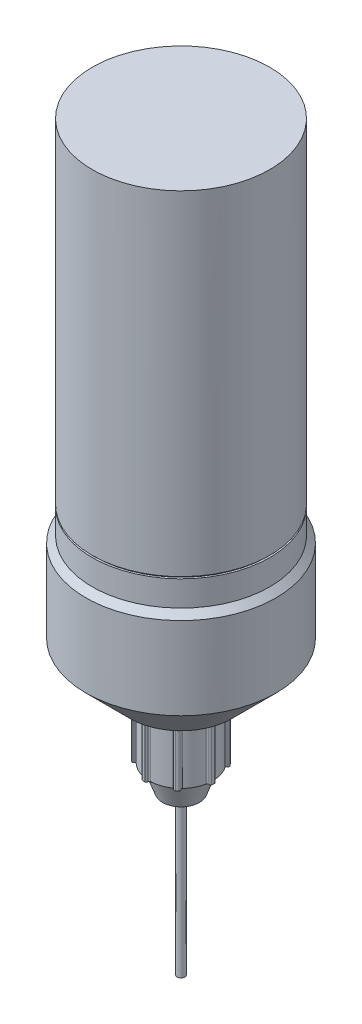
ISO-10303-21;
HEADER;
FILE_DESCRIPTION(('STEP AP214'),'2;1');
FILE_NAME('part.step','',(''),(''),'','','');
FILE_SCHEMA(('AUTOMOTIVE_DESIGN { 1 0 10303 214 1 1 1 1 }'));
ENDSEC;
DATA;
#1=APPLICATION_CONTEXT('core data for automotive mechanical design processes');
#2=APPLICATION_PROTOCOL_DEFINITION('international standard','automotive_design',2000,#1);
#3=PRODUCT_CONTEXT('',#1,'mechanical');
#4=PRODUCT('Part','Part','',(#3));
#5=PRODUCT_RELATED_PRODUCT_CATEGORY('part','',(#4));
#6=PRODUCT_DEFINITION_FORMATION('','',#4);
#7=PRODUCT_DEFINITION_CONTEXT('part definition',#1,'design');
#8=PRODUCT_DEFINITION('design','',#6,#7);
#9=PRODUCT_DEFINITION_SHAPE('','',#8);
#10=(LENGTH_UNIT() NAMED_UNIT(*) SI_UNIT(.MILLI.,.METRE.));
#11=(NAMED_UNIT(*) PLANE_ANGLE_UNIT() SI_UNIT($,.RADIAN.));
#12=(NAMED_UNIT(*) SI_UNIT($,.STERADIAN.) SOLID_ANGLE_UNIT());
#13=UNCERTAINTY_MEASURE_WITH_UNIT(LENGTH_MEASURE(1.E-05),#10,'distance_accuracy_value','');
#14=(GEOMETRIC_REPRESENTATION_CONTEXT(3) GLOBAL_UNCERTAINTY_ASSIGNED_CONTEXT((#13)) GLOBAL_UNIT_ASSIGNED_CONTEXT((#10,
#11,#12)) REPRESENTATION_CONTEXT('',''));
#15=CARTESIAN_POINT('',(0.,0.,0.));
#16=DIRECTION('',(0.,0.,1.));
#17=DIRECTION('',(1.,0.,0.));
#18=AXIS2_PLACEMENT_3D('',#15,#16,#17);
#19=CARTESIAN_POINT('',(0.,-14.2531803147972,0.));
#20=DIRECTION('',(0.,-1.,0.));
#21=DIRECTION('',(0.,0.,-1.));
#22=AXIS2_PLACEMENT_3D('',#19,#20,#21);
#23=PLANE('',#22);
#24=CARTESIAN_POINT('',(0.,-14.2531803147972,0.));
#25=DIRECTION('',(0.,-1.,0.));
#26=DIRECTION('',(0.,0.,-1.));
#27=AXIS2_PLACEMENT_3D('',#24,#25,#26);
#28=CIRCLE('',#27,0.4);
#29=CARTESIAN_POINT('',(0.,-14.2531803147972,-0.4));
#30=VERTEX_POINT('',#29);
#31=EDGE_CURVE('E20',#30,#30,#28,.T.);
#32=ORIENTED_EDGE('',*,*,#31,.T.);
#33=EDGE_LOOP('',(#32));
#34=FACE_BOUND('',#33,.T.);
#35=ADVANCED_FACE('F17',(#34),#23,.T.);
#36=CARTESIAN_POINT('',(0.,-14.2531803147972,0.));
#37=DIRECTION('',(0.,-1.,0.));
#38=DIRECTION('',(0.,0.,-1.));
#39=AXIS2_PLACEMENT_3D('',#36,#37,#38);
#40=CYLINDRICAL_SURFACE('',#39,0.4);
#41=CARTESIAN_POINT('',(0.,-52.2531803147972,0.));
#42=DIRECTION('',(0.,-1.,0.));
#43=DIRECTION('',(0.,0.,-1.));
#44=AXIS2_PLACEMENT_3D('',#41,#42,#43);
#45=CIRCLE('',#44,0.4);
#46=CARTESIAN_POINT('',(0.,-52.2531803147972,-0.4));
#47=VERTEX_POINT('',#46);
#48=EDGE_CURVE('E453',#47,#47,#45,.F.);
#49=ORIENTED_EDGE('',*,*,#48,.F.);
#50=EDGE_LOOP('',(#49));
#51=FACE_BOUND('',#50,.T.);
#52=ORIENTED_EDGE('',*,*,#31,.F.);
#53=EDGE_LOOP('',(#52));
#54=FACE_BOUND('',#53,.T.);
#55=ADVANCED_FACE('F461',(#51,#54),#40,.F.);
#56=CARTESIAN_POINT('',(0.,-52.2531803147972,0.));
#57=DIRECTION('',(0.,-1.,0.));
#58=DIRECTION('',(0.,0.,-1.));
#59=AXIS2_PLACEMENT_3D('',#56,#57,#58);
#60=PLANE('',#59);
#61=CARTESIAN_POINT('',(0.,-52.2531803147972,0.));
#62=DIRECTION('',(0.,1.,0.));
#63=DIRECTION('',(0.,0.,1.));
#64=AXIS2_PLACEMENT_3D('',#61,#62,#63);
#65=CIRCLE('',#64,0.6);
#66=CARTESIAN_POINT('',(0.,-52.2531803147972,0.6));
#67=VERTEX_POINT('',#66);
#68=EDGE_CURVE('E1086',#67,#67,#65,.T.);
#69=ORIENTED_EDGE('',*,*,#68,.F.);
#70=EDGE_LOOP('',(#69));
#71=FACE_BOUND('',#70,.T.);
#72=ORIENTED_EDGE('',*,*,#48,.T.);
#73=EDGE_LOOP('',(#72));
#74=FACE_BOUND('',#73,.T.);
#75=ADVANCED_FACE('F463',(#71,#74),#60,.T.);
#76=CARTESIAN_POINT('',(3.28559934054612,-23.2531803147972,4.15870616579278));
#77=DIRECTION('',(0.,1.,0.));
#78=DIRECTION('',(0.,0.,1.));
#79=AXIS2_PLACEMENT_3D('',#76,#77,#78);
#80=CYLINDRICAL_SURFACE('',#79,0.2);
#81=CARTESIAN_POINT('',(3.28559934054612,-13.2531803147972,4.15870616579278));
#82=DIRECTION('',(0.,1.,0.));
#83=DIRECTION('',(0.,0.,1.));
#84=AXIS2_PLACEMENT_3D('',#81,#82,#83);
#85=CIRCLE('',#84,0.2);
#86=CARTESIAN_POINT('',(3.40958422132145,-13.2531803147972,4.3156384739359));
#87=VERTEX_POINT('',#86);
#88=CARTESIAN_POINT('',(3.12410013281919,-13.2531803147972,4.27668076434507));
#89=VERTEX_POINT('',#88);
#90=EDGE_CURVE('E449',#87,#89,#85,.F.);
#91=ORIENTED_EDGE('',*,*,#90,.T.);
#92=DIRECTION('',(0.,1.,0.));
#93=VECTOR('',#92,1.);
#94=CARTESIAN_POINT('',(3.12410013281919,-13.2531803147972,4.27668076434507));
#95=LINE('',#94,#93);
#96=CARTESIAN_POINT('',(3.12410013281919,-23.2531803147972,4.27668076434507));
#97=VERTEX_POINT('',#96);
#98=EDGE_CURVE('E782',#89,#97,#95,.F.);
#99=ORIENTED_EDGE('',*,*,#98,.T.);
#100=CARTESIAN_POINT('',(3.28559934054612,-23.2531803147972,4.15870616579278));
#101=DIRECTION('',(0.,1.,0.));
#102=DIRECTION('',(0.,0.,1.));
#103=AXIS2_PLACEMENT_3D('',#100,#101,#102);
#104=CIRCLE('',#103,0.2);
#105=CARTESIAN_POINT('',(3.40958422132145,-23.2531803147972,4.3156384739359));
#106=VERTEX_POINT('',#105);
#107=EDGE_CURVE('E452',#97,#106,#104,.T.);
#108=ORIENTED_EDGE('',*,*,#107,.T.);
#109=DIRECTION('',(0.,1.,0.));
#110=VECTOR('',#109,1.);
#111=CARTESIAN_POINT('',(3.40958422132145,-23.2531803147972,4.3156384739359));
#112=LINE('',#111,#110);
#113=EDGE_CURVE('E785',#87,#106,#112,.F.);
#114=ORIENTED_EDGE('',*,*,#113,.F.);
#115=EDGE_LOOP('',(#91,#99,#108,#114));
#116=FACE_BOUND('',#115,.T.);
#117=ADVANCED_FACE('F470',(#116),#80,.T.);
#118=CARTESIAN_POINT('',(0.,-23.2531803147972,0.));
#119=DIRECTION('',(0.,1.,0.));
#120=DIRECTION('',(0.,0.,1.));
#121=AXIS2_PLACEMENT_3D('',#118,#119,#120);
#122=CYLINDRICAL_SURFACE('',#121,5.5);
#123=CARTESIAN_POINT('',(0.,-23.2531803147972,0.));
#124=DIRECTION('',(0.,1.,0.));
#125=DIRECTION('',(0.,0.,1.));
#126=AXIS2_PLACEMENT_3D('',#123,#124,#125);
#127=CIRCLE('',#126,5.5);
#128=CARTESIAN_POINT('',(-0.640677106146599,-23.2531803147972,5.46255735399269));
#129=VERTEX_POINT('',#128);
#130=CARTESIAN_POINT('',(-0.207547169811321,-23.2531803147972,5.49608262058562));
#131=VERTEX_POINT('',#130);
#132=EDGE_CURVE('E443',#129,#131,#127,.T.);
#133=ORIENTED_EDGE('',*,*,#132,.T.);
#134=DIRECTION('',(0.,1.,0.));
#135=VECTOR('',#134,1.);
#136=CARTESIAN_POINT('',(-0.207547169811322,-23.2531803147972,5.49608262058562));
#137=LINE('',#136,#135);
#138=CARTESIAN_POINT('',(-0.207547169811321,-13.2531803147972,5.49608262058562));
#139=VERTEX_POINT('',#138);
#140=EDGE_CURVE('E423',#131,#139,#137,.T.);
#141=ORIENTED_EDGE('',*,*,#140,.T.);
#142=CARTESIAN_POINT('',(0.,-13.2531803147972,0.));
#143=DIRECTION('',(0.,1.,0.));
#144=DIRECTION('',(0.,0.,1.));
#145=AXIS2_PLACEMENT_3D('',#142,#143,#144);
#146=CIRCLE('',#145,5.5);
#147=CARTESIAN_POINT('',(-0.640677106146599,-13.2531803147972,5.46255735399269));
#148=VERTEX_POINT('',#147);
#149=EDGE_CURVE('E446',#139,#148,#146,.F.);
#150=ORIENTED_EDGE('',*,*,#149,.T.);
#151=DIRECTION('',(0.,1.,0.));
#152=VECTOR('',#151,1.);
#153=CARTESIAN_POINT('',(-0.640677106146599,-23.2531803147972,5.46255735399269));
#154=LINE('',#153,#152);
#155=EDGE_CURVE('E799',#129,#148,#154,.T.);
#156=ORIENTED_EDGE('',*,*,#155,.F.);
#157=EDGE_LOOP('',(#133,#141,#150,#156));
#158=FACE_BOUND('',#157,.T.);
#159=ADVANCED_FACE('F771',(#158),#122,.T.);
#160=CARTESIAN_POINT('',(-3.88641801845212,-23.2531803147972,3.60357530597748));
#161=DIRECTION('',(0.,1.,0.));
#162=DIRECTION('',(0.,0.,1.));
#163=AXIS2_PLACEMENT_3D('',#160,#161,#162);
#164=CYLINDRICAL_SURFACE('',#163,0.2);
#165=DIRECTION('',(0.,1.,0.));
#166=VECTOR('',#165,1.);
#167=CARTESIAN_POINT('',(-3.74499666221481,-13.2531803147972,3.74499666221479));
#168=LINE('',#167,#166);
#169=CARTESIAN_POINT('',(-3.74499666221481,-23.2531803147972,3.74499666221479));
#170=VERTEX_POINT('',#169);
#171=CARTESIAN_POINT('',(-3.74499666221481,-13.2531803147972,3.74499666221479));
#172=VERTEX_POINT('',#171);
#173=EDGE_CURVE('E1120',#170,#172,#168,.T.);
#174=ORIENTED_EDGE('',*,*,#173,.T.);
#175=CARTESIAN_POINT('',(-3.88641801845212,-13.2531803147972,3.60357530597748));
#176=DIRECTION('',(0.,1.,0.));
#177=DIRECTION('',(0.,0.,1.));
#178=AXIS2_PLACEMENT_3D('',#175,#176,#177);
#179=CIRCLE('',#178,0.2);
#180=CARTESIAN_POINT('',(-4.03307530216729,-13.2531803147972,3.73955927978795));
#181=VERTEX_POINT('',#180);
#182=EDGE_CURVE('E409',#172,#181,#179,.F.);
#183=ORIENTED_EDGE('',*,*,#182,.T.);
#184=DIRECTION('',(0.,1.,0.));
#185=VECTOR('',#184,1.);
#186=CARTESIAN_POINT('',(-4.03307530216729,-23.2531803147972,3.73955927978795));
#187=LINE('',#186,#185);
#188=CARTESIAN_POINT('',(-4.03307530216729,-23.2531803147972,3.73955927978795));
#189=VERTEX_POINT('',#188);
#190=EDGE_CURVE('E426',#189,#181,#187,.T.);
#191=ORIENTED_EDGE('',*,*,#190,.F.);
#192=CARTESIAN_POINT('',(-3.88641801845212,-23.2531803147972,3.60357530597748));
#193=DIRECTION('',(0.,1.,0.));
#194=DIRECTION('',(0.,0.,1.));
#195=AXIS2_PLACEMENT_3D('',#192,#193,#194);
#196=CIRCLE('',#195,0.2);
#197=EDGE_CURVE('E414',#189,#170,#196,.T.);
#198=ORIENTED_EDGE('',*,*,#197,.T.);
#199=EDGE_LOOP('',(#174,#183,#191,#198));
#200=FACE_BOUND('',#199,.T.);
#201=ADVANCED_FACE('F427',(#200),#164,.T.);
#202=CARTESIAN_POINT('',(0.,-23.2531803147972,0.));
#203=DIRECTION('',(0.,1.,0.));
#204=DIRECTION('',(0.,0.,1.));
#205=AXIS2_PLACEMENT_3D('',#202,#203,#204);
#206=CYLINDRICAL_SURFACE('',#205,5.5);
#207=CARTESIAN_POINT('',(0.,-23.2531803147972,0.));
#208=DIRECTION('',(0.,1.,0.));
#209=DIRECTION('',(0.,0.,1.));
#210=AXIS2_PLACEMENT_3D('',#207,#208,#209);
#211=CIRCLE('',#210,5.5);
#212=CARTESIAN_POINT('',(-4.31563847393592,-23.2531803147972,3.40958422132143));
#213=VERTEX_POINT('',#212);
#214=EDGE_CURVE('E418',#213,#189,#211,.T.);
#215=ORIENTED_EDGE('',*,*,#214,.T.);
#216=ORIENTED_EDGE('',*,*,#190,.T.);
#217=CARTESIAN_POINT('',(0.,-13.2531803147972,0.));
#218=DIRECTION('',(0.,1.,0.));
#219=DIRECTION('',(0.,0.,1.));
#220=AXIS2_PLACEMENT_3D('',#217,#218,#219);
#221=CIRCLE('',#220,5.5);
#222=CARTESIAN_POINT('',(-4.31563847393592,-13.2531803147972,3.40958422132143));
#223=VERTEX_POINT('',#222);
#224=EDGE_CURVE('E436',#181,#223,#221,.F.);
#225=ORIENTED_EDGE('',*,*,#224,.T.);
#226=DIRECTION('',(0.,1.,0.));
#227=VECTOR('',#226,1.);
#228=CARTESIAN_POINT('',(-4.31563847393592,-23.2531803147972,3.40958422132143));
#229=LINE('',#228,#227);
#230=EDGE_CURVE('E434',#213,#223,#229,.T.);
#231=ORIENTED_EDGE('',*,*,#230,.F.);
#232=EDGE_LOOP('',(#215,#216,#225,#231));
#233=FACE_BOUND('',#232,.T.);
#234=ADVANCED_FACE('F432',(#233),#206,.T.);
#235=CARTESIAN_POINT('',(0.,-23.2531803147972,0.));
#236=DIRECTION('',(0.,1.,0.));
#237=DIRECTION('',(0.,0.,1.));
#238=AXIS2_PLACEMENT_3D('',#235,#236,#237);
#239=CYLINDRICAL_SURFACE('',#238,5.5);
#240=CARTESIAN_POINT('',(0.,-23.2531803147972,0.));
#241=DIRECTION('',(0.,1.,0.));
#242=DIRECTION('',(0.,0.,1.));
#243=AXIS2_PLACEMENT_3D('',#240,#241,#242);
#244=CIRCLE('',#243,5.5);
#245=CARTESIAN_POINT('',(-5.46255735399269,-23.2531803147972,-0.640677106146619));
#246=VERTEX_POINT('',#245);
#247=CARTESIAN_POINT('',(-5.49608262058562,-23.2531803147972,-0.20754716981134));
#248=VERTEX_POINT('',#247);
#249=EDGE_CURVE('E1106',#246,#248,#244,.T.);
#250=ORIENTED_EDGE('',*,*,#249,.T.);
#251=DIRECTION('',(0.,1.,0.));
#252=VECTOR('',#251,1.);
#253=CARTESIAN_POINT('',(-5.49608262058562,-23.2531803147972,-0.20754716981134));
#254=LINE('',#253,#252);
#255=CARTESIAN_POINT('',(-5.49608262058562,-13.2531803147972,-0.20754716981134));
#256=VERTEX_POINT('',#255);
#257=EDGE_CURVE('E1058',#256,#248,#254,.F.);
#258=ORIENTED_EDGE('',*,*,#257,.F.);
#259=CARTESIAN_POINT('',(0.,-13.2531803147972,0.));
#260=DIRECTION('',(0.,1.,0.));
#261=DIRECTION('',(0.,0.,1.));
#262=AXIS2_PLACEMENT_3D('',#259,#260,#261);
#263=CIRCLE('',#262,5.5);
#264=CARTESIAN_POINT('',(-5.46255735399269,-13.2531803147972,-0.640677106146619));
#265=VERTEX_POINT('',#264);
#266=EDGE_CURVE('E430',#256,#265,#263,.F.);
#267=ORIENTED_EDGE('',*,*,#266,.T.);
#268=DIRECTION('',(0.,1.,0.));
#269=VECTOR('',#268,1.);
#270=CARTESIAN_POINT('',(-5.46255735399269,-23.2531803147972,-0.640677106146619));
#271=LINE('',#270,#269);
#272=EDGE_CURVE('E1048',#246,#265,#271,.T.);
#273=ORIENTED_EDGE('',*,*,#272,.F.);
#274=EDGE_LOOP('',(#250,#258,#267,#273));
#275=FACE_BOUND('',#274,.T.);
#276=ADVANCED_FACE('F762',(#275),#239,.T.);
#277=CARTESIAN_POINT('',(0.,-23.2531803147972,0.));
#278=DIRECTION('',(0.,1.,0.));
#279=DIRECTION('',(0.,0.,1.));
#280=AXIS2_PLACEMENT_3D('',#277,#278,#279);
#281=CYLINDRICAL_SURFACE('',#280,5.5);
#282=CARTESIAN_POINT('',(0.,-23.2531803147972,0.));
#283=DIRECTION('',(0.,1.,0.));
#284=DIRECTION('',(0.,0.,1.));
#285=AXIS2_PLACEMENT_3D('',#282,#283,#284);
#286=CIRCLE('',#285,5.5);
#287=CARTESIAN_POINT('',(-3.40958422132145,-23.2531803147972,-4.3156384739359));
#288=VERTEX_POINT('',#287);
#289=CARTESIAN_POINT('',(-3.73955927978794,-23.2531803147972,-4.0330753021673));
#290=VERTEX_POINT('',#289);
#291=EDGE_CURVE('E1102',#288,#290,#286,.T.);
#292=ORIENTED_EDGE('',*,*,#291,.T.);
#293=DIRECTION('',(0.,1.,0.));
#294=VECTOR('',#293,1.);
#295=CARTESIAN_POINT('',(-3.73955927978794,-23.2531803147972,-4.0330753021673));
#296=LINE('',#295,#294);
#297=CARTESIAN_POINT('',(-3.73955927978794,-13.2531803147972,-4.0330753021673));
#298=VERTEX_POINT('',#297);
#299=EDGE_CURVE('E1044',#298,#290,#296,.F.);
#300=ORIENTED_EDGE('',*,*,#299,.F.);
#301=CARTESIAN_POINT('',(0.,-13.2531803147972,0.));
#302=DIRECTION('',(0.,1.,0.));
#303=DIRECTION('',(0.,0.,1.));
#304=AXIS2_PLACEMENT_3D('',#301,#302,#303);
#305=CIRCLE('',#304,5.5);
#306=CARTESIAN_POINT('',(-3.40958422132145,-13.2531803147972,-4.3156384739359));
#307=VERTEX_POINT('',#306);
#308=EDGE_CURVE('E1104',#298,#307,#305,.F.);
#309=ORIENTED_EDGE('',*,*,#308,.T.);
#310=DIRECTION('',(0.,1.,0.));
#311=VECTOR('',#310,1.);
#312=CARTESIAN_POINT('',(-3.40958422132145,-23.2531803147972,-4.3156384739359));
#313=LINE('',#312,#311);
#314=EDGE_CURVE('E1034',#288,#307,#313,.T.);
#315=ORIENTED_EDGE('',*,*,#314,.F.);
#316=EDGE_LOOP('',(#292,#300,#309,#315));
#317=FACE_BOUND('',#316,.T.);
#318=ADVANCED_FACE('F758',(#317),#281,.T.);
#319=CARTESIAN_POINT('',(0.,-23.2531803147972,0.));
#320=DIRECTION('',(0.,1.,0.));
#321=DIRECTION('',(0.,0.,1.));
#322=AXIS2_PLACEMENT_3D('',#319,#320,#321);
#323=CYLINDRICAL_SURFACE('',#322,5.5);
#324=CARTESIAN_POINT('',(0.,-23.2531803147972,0.));
#325=DIRECTION('',(0.,1.,0.));
#326=DIRECTION('',(0.,0.,1.));
#327=AXIS2_PLACEMENT_3D('',#324,#325,#326);
#328=CIRCLE('',#327,5.5);
#329=CARTESIAN_POINT('',(0.640677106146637,-23.2531803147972,-5.46255735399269));
#330=VERTEX_POINT('',#329);
#331=CARTESIAN_POINT('',(0.207547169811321,-23.2531803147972,-5.49608262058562));
#332=VERTEX_POINT('',#331);
#333=EDGE_CURVE('E1097',#330,#332,#328,.T.);
#334=ORIENTED_EDGE('',*,*,#333,.T.);
#335=DIRECTION('',(0.,1.,0.));
#336=VECTOR('',#335,1.);
#337=CARTESIAN_POINT('',(0.207547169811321,-23.2531803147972,-5.49608262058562));
#338=LINE('',#337,#336);
#339=CARTESIAN_POINT('',(0.207547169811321,-13.2531803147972,-5.49608262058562));
#340=VERTEX_POINT('',#339);
#341=EDGE_CURVE('E1030',#340,#332,#338,.F.);
#342=ORIENTED_EDGE('',*,*,#341,.F.);
#343=CARTESIAN_POINT('',(0.,-13.2531803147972,0.));
#344=DIRECTION('',(0.,1.,0.));
#345=DIRECTION('',(0.,0.,1.));
#346=AXIS2_PLACEMENT_3D('',#343,#344,#345);
#347=CIRCLE('',#346,5.5);
#348=CARTESIAN_POINT('',(0.640677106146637,-13.2531803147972,-5.46255735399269));
#349=VERTEX_POINT('',#348);
#350=EDGE_CURVE('E1099',#340,#349,#347,.F.);
#351=ORIENTED_EDGE('',*,*,#350,.T.);
#352=DIRECTION('',(0.,1.,0.));
#353=VECTOR('',#352,1.);
#354=CARTESIAN_POINT('',(0.640677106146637,-23.2531803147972,-5.46255735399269));
#355=LINE('',#354,#353);
#356=EDGE_CURVE('E1020',#330,#349,#355,.T.);
#357=ORIENTED_EDGE('',*,*,#356,.F.);
#358=EDGE_LOOP('',(#334,#342,#351,#357));
#359=FACE_BOUND('',#358,.T.);
#360=ADVANCED_FACE('F754',(#359),#323,.T.);
#361=CARTESIAN_POINT('',(0.,-23.2531803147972,0.));
#362=DIRECTION('',(0.,1.,0.));
#363=DIRECTION('',(0.,0.,1.));
#364=AXIS2_PLACEMENT_3D('',#361,#362,#363);
#365=CYLINDRICAL_SURFACE('',#364,5.5);
#366=CARTESIAN_POINT('',(0.,-23.2531803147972,0.));
#367=DIRECTION('',(0.,1.,0.));
#368=DIRECTION('',(0.,0.,1.));
#369=AXIS2_PLACEMENT_3D('',#366,#367,#368);
#370=CIRCLE('',#369,5.5);
#371=CARTESIAN_POINT('',(4.31563847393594,-23.2531803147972,-3.4095842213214));
#372=VERTEX_POINT('',#371);
#373=CARTESIAN_POINT('',(4.03307530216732,-23.2531803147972,-3.73955927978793));
#374=VERTEX_POINT('',#373);
#375=EDGE_CURVE('E1092',#372,#374,#370,.T.);
#376=ORIENTED_EDGE('',*,*,#375,.T.);
#377=DIRECTION('',(0.,1.,0.));
#378=VECTOR('',#377,1.);
#379=CARTESIAN_POINT('',(4.03307530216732,-23.2531803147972,-3.73955927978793));
#380=LINE('',#379,#378);
#381=CARTESIAN_POINT('',(4.03307530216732,-13.2531803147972,-3.73955927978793));
#382=VERTEX_POINT('',#381);
#383=EDGE_CURVE('E1016',#382,#374,#380,.F.);
#384=ORIENTED_EDGE('',*,*,#383,.F.);
#385=CARTESIAN_POINT('',(0.,-13.2531803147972,0.));
#386=DIRECTION('',(0.,1.,0.));
#387=DIRECTION('',(0.,0.,1.));
#388=AXIS2_PLACEMENT_3D('',#385,#386,#387);
#389=CIRCLE('',#388,5.5);
#390=CARTESIAN_POINT('',(4.31563847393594,-13.2531803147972,-3.4095842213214));
#391=VERTEX_POINT('',#390);
#392=EDGE_CURVE('E1094',#382,#391,#389,.F.);
#393=ORIENTED_EDGE('',*,*,#392,.T.);
#394=DIRECTION('',(0.,1.,0.));
#395=VECTOR('',#394,1.);
#396=CARTESIAN_POINT('',(4.31563847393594,-23.2531803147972,-3.4095842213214));
#397=LINE('',#396,#395);
#398=EDGE_CURVE('E1006',#372,#391,#397,.T.);
#399=ORIENTED_EDGE('',*,*,#398,.F.);
#400=EDGE_LOOP('',(#376,#384,#393,#399));
#401=FACE_BOUND('',#400,.T.);
#402=ADVANCED_FACE('F750',(#401),#365,.T.);
#403=CARTESIAN_POINT('',(0.,-23.2531803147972,0.));
#404=DIRECTION('',(0.,1.,0.));
#405=DIRECTION('',(0.,0.,1.));
#406=AXIS2_PLACEMENT_3D('',#403,#404,#405);
#407=CYLINDRICAL_SURFACE('',#406,5.5);
#408=CARTESIAN_POINT('',(0.,-23.2531803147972,0.));
#409=DIRECTION('',(0.,1.,0.));
#410=DIRECTION('',(0.,0.,1.));
#411=AXIS2_PLACEMENT_3D('',#408,#409,#410);
#412=CIRCLE('',#411,5.5);
#413=CARTESIAN_POINT('',(5.46255735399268,-23.2531803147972,0.640677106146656));
#414=VERTEX_POINT('',#413);
#415=CARTESIAN_POINT('',(5.49608262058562,-23.2531803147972,0.207547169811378));
#416=VERTEX_POINT('',#415);
#417=EDGE_CURVE('E805',#414,#416,#412,.T.);
#418=ORIENTED_EDGE('',*,*,#417,.T.);
#419=DIRECTION('',(0.,1.,0.));
#420=VECTOR('',#419,1.);
#421=CARTESIAN_POINT('',(5.49608262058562,-23.2531803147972,0.207547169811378));
#422=LINE('',#421,#420);
#423=CARTESIAN_POINT('',(5.49608262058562,-13.2531803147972,0.207547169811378));
#424=VERTEX_POINT('',#423);
#425=EDGE_CURVE('E1002',#424,#416,#422,.F.);
#426=ORIENTED_EDGE('',*,*,#425,.F.);
#427=CARTESIAN_POINT('',(0.,-13.2531803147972,0.));
#428=DIRECTION('',(0.,1.,0.));
#429=DIRECTION('',(0.,0.,1.));
#430=AXIS2_PLACEMENT_3D('',#427,#428,#429);
#431=CIRCLE('',#430,5.5);
#432=CARTESIAN_POINT('',(5.46255735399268,-13.2531803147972,0.640677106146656));
#433=VERTEX_POINT('',#432);
#434=EDGE_CURVE('E806',#424,#433,#431,.F.);
#435=ORIENTED_EDGE('',*,*,#434,.T.);
#436=DIRECTION('',(0.,1.,0.));
#437=VECTOR('',#436,1.);
#438=CARTESIAN_POINT('',(5.46255735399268,-23.2531803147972,0.640677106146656));
#439=LINE('',#438,#437);
#440=EDGE_CURVE('E803',#433,#414,#439,.F.);
#441=ORIENTED_EDGE('',*,*,#440,.T.);
#442=EDGE_LOOP('',(#418,#426,#435,#441));
#443=FACE_BOUND('',#442,.T.);
#444=ADVANCED_FACE('F746',(#443),#407,.T.);
#445=CARTESIAN_POINT('',(0.,-52.2531803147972,0.));
#446=DIRECTION('',(0.,1.,0.));
#447=DIRECTION('',(0.,0.,1.));
#448=AXIS2_PLACEMENT_3D('',#445,#446,#447);
#449=CYLINDRICAL_SURFACE('',#448,0.6);
#450=CARTESIAN_POINT('',(0.,-27.2531803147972,0.));
#451=DIRECTION('',(0.,1.,0.));
#452=DIRECTION('',(0.,0.,1.));
#453=AXIS2_PLACEMENT_3D('',#450,#451,#452);
#454=CIRCLE('',#453,0.6);
#455=CARTESIAN_POINT('',(0.,-27.2531803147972,0.6));
#456=VERTEX_POINT('',#455);
#457=EDGE_CURVE('E995',#456,#456,#454,.T.);
#458=ORIENTED_EDGE('',*,*,#457,.F.);
#459=EDGE_LOOP('',(#458));
#460=FACE_BOUND('',#459,.T.);
#461=ORIENTED_EDGE('',*,*,#68,.T.);
#462=EDGE_LOOP('',(#461));
#463=FACE_BOUND('',#462,.T.);
#464=ADVANCED_FACE('F742',(#460,#463),#449,.T.);
#465=CARTESIAN_POINT('',(5.26391890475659,-23.2531803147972,0.617379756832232));
#466=DIRECTION('',(0.,1.,0.));
#467=DIRECTION('',(0.,0.,1.));
#468=AXIS2_PLACEMENT_3D('',#465,#466,#467);
#469=CYLINDRICAL_SURFACE('',#468,0.2);
#470=CARTESIAN_POINT('',(5.26391890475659,-13.2531803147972,0.617379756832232));
#471=DIRECTION('',(0.,1.,0.));
#472=DIRECTION('',(0.,0.,1.));
#473=AXIS2_PLACEMENT_3D('',#470,#471,#472);
#474=CIRCLE('',#473,0.2);
#475=CARTESIAN_POINT('',(5.2331423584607,-13.2531803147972,0.814997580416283));
#476=VERTEX_POINT('',#475);
#477=EDGE_CURVE('E1081',#433,#476,#474,.F.);
#478=ORIENTED_EDGE('',*,*,#477,.T.);
#479=DIRECTION('',(0.,1.,0.));
#480=VECTOR('',#479,1.);
#481=CARTESIAN_POINT('',(5.2331423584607,-13.2531803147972,0.814997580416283));
#482=LINE('',#481,#480);
#483=CARTESIAN_POINT('',(5.2331423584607,-23.2531803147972,0.814997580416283));
#484=VERTEX_POINT('',#483);
#485=EDGE_CURVE('E1141',#476,#484,#482,.F.);
#486=ORIENTED_EDGE('',*,*,#485,.T.);
#487=CARTESIAN_POINT('',(5.26391890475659,-23.2531803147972,0.617379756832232));
#488=DIRECTION('',(0.,1.,0.));
#489=DIRECTION('',(0.,0.,1.));
#490=AXIS2_PLACEMENT_3D('',#487,#488,#489);
#491=CIRCLE('',#490,0.2);
#492=EDGE_CURVE('E1084',#484,#414,#491,.T.);
#493=ORIENTED_EDGE('',*,*,#492,.T.);
#494=ORIENTED_EDGE('',*,*,#440,.F.);
#495=EDGE_LOOP('',(#478,#486,#493,#494));
#496=FACE_BOUND('',#495,.T.);
#497=ADVANCED_FACE('F738',(#496),#469,.T.);
#498=CARTESIAN_POINT('',(0.,-23.2531803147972,0.));
#499=DIRECTION('',(0.,1.,0.));
#500=DIRECTION('',(0.,0.,1.));
#501=AXIS2_PLACEMENT_3D('',#498,#499,#500);
#502=CYLINDRICAL_SURFACE('',#501,5.5);
#503=CARTESIAN_POINT('',(0.,-13.2531803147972,0.));
#504=DIRECTION('',(0.,1.,0.));
#505=DIRECTION('',(0.,0.,1.));
#506=AXIS2_PLACEMENT_3D('',#503,#504,#505);
#507=CIRCLE('',#506,5.5);
#508=CARTESIAN_POINT('',(3.73955927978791,-13.2531803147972,4.03307530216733));
#509=VERTEX_POINT('',#508);
#510=EDGE_CURVE('E802',#509,#87,#507,.F.);
#511=ORIENTED_EDGE('',*,*,#510,.T.);
#512=ORIENTED_EDGE('',*,*,#113,.T.);
#513=CARTESIAN_POINT('',(0.,-23.2531803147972,0.));
#514=DIRECTION('',(0.,1.,0.));
#515=DIRECTION('',(0.,0.,1.));
#516=AXIS2_PLACEMENT_3D('',#513,#514,#515);
#517=CIRCLE('',#516,5.5);
#518=CARTESIAN_POINT('',(3.73955927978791,-23.2531803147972,4.03307530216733));
#519=VERTEX_POINT('',#518);
#520=EDGE_CURVE('E1079',#106,#519,#517,.T.);
#521=ORIENTED_EDGE('',*,*,#520,.T.);
#522=DIRECTION('',(0.,1.,0.));
#523=VECTOR('',#522,1.);
#524=CARTESIAN_POINT('',(3.73955927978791,-23.2531803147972,4.03307530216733));
#525=LINE('',#524,#523);
#526=EDGE_CURVE('E990',#509,#519,#525,.F.);
#527=ORIENTED_EDGE('',*,*,#526,.F.);
#528=EDGE_LOOP('',(#511,#512,#521,#527));
#529=FACE_BOUND('',#528,.T.);
#530=ADVANCED_FACE('F734',(#529),#502,.T.);
#531=CARTESIAN_POINT('',(3.24430146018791,-13.2531803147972,4.44122821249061));
#532=DIRECTION('',(0.807496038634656,0.,-0.589872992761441));
#533=DIRECTION('',(-0.589872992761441,0.,-0.807496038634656));
#534=AXIS2_PLACEMENT_3D('',#531,#532,#533);
#535=PLANE('',#534);
#536=ORIENTED_EDGE('',*,*,#98,.F.);
#537=DIRECTION('',(-0.589872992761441,0.,-0.807496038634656));
#538=VECTOR('',#537,1.);
#539=CARTESIAN_POINT('',(3.24430146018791,-13.2531803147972,4.44122821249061));
#540=LINE('',#539,#538);
#541=CARTESIAN_POINT('',(3.06506998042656,-13.2531803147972,4.19587249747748));
#542=VERTEX_POINT('',#541);
#543=EDGE_CURVE('E789',#542,#89,#540,.F.);
#544=ORIENTED_EDGE('',*,*,#543,.F.);
#545=DIRECTION('',(0.,-1.,0.));
#546=VECTOR('',#545,1.);
#547=CARTESIAN_POINT('',(3.06506998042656,-13.2531803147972,4.19587249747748));
#548=LINE('',#547,#546);
#549=CARTESIAN_POINT('',(3.06506998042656,-23.2531803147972,4.19587249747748));
#550=VERTEX_POINT('',#549);
#551=EDGE_CURVE('E989',#542,#550,#548,.T.);
#552=ORIENTED_EDGE('',*,*,#551,.T.);
#553=DIRECTION('',(-0.589872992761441,0.,-0.807496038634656));
#554=VECTOR('',#553,1.);
#555=CARTESIAN_POINT('',(3.24430146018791,-23.2531803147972,4.44122821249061));
#556=LINE('',#555,#554);
#557=EDGE_CURVE('E792',#97,#550,#556,.T.);
#558=ORIENTED_EDGE('',*,*,#557,.F.);
#559=EDGE_LOOP('',(#536,#544,#552,#558));
#560=FACE_BOUND('',#559,.T.);
#561=ADVANCED_FACE('F730',(#560),#535,.F.);
#562=CARTESIAN_POINT('',(-0.2,-23.2531803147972,5.29622507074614));
#563=DIRECTION('',(0.,1.,0.));
#564=DIRECTION('',(0.,0.,1.));
#565=AXIS2_PLACEMENT_3D('',#562,#563,#564);
#566=CYLINDRICAL_SURFACE('',#565,0.2);
#567=DIRECTION('',(0.,1.,0.));
#568=VECTOR('',#567,1.);
#569=CARTESIAN_POINT('',(0.,-13.2531803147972,5.29622507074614));
#570=LINE('',#569,#568);
#571=CARTESIAN_POINT('',(0.,-23.2531803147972,5.29622507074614));
#572=VERTEX_POINT('',#571);
#573=CARTESIAN_POINT('',(0.,-13.2531803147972,5.29622507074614));
#574=VERTEX_POINT('',#573);
#575=EDGE_CURVE('E1133',#572,#574,#570,.T.);
#576=ORIENTED_EDGE('',*,*,#575,.T.);
#577=CARTESIAN_POINT('',(-0.2,-13.2531803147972,5.29622507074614));
#578=DIRECTION('',(0.,1.,0.));
#579=DIRECTION('',(0.,0.,1.));
#580=AXIS2_PLACEMENT_3D('',#577,#578,#579);
#581=CIRCLE('',#580,0.2);
#582=EDGE_CURVE('E1074',#574,#139,#581,.F.);
#583=ORIENTED_EDGE('',*,*,#582,.T.);
#584=ORIENTED_EDGE('',*,*,#140,.F.);
#585=CARTESIAN_POINT('',(-0.2,-23.2531803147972,5.29622507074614));
#586=DIRECTION('',(0.,1.,0.));
#587=DIRECTION('',(0.,0.,1.));
#588=AXIS2_PLACEMENT_3D('',#585,#586,#587);
#589=CIRCLE('',#588,0.2);
#590=EDGE_CURVE('E794',#131,#572,#589,.T.);
#591=ORIENTED_EDGE('',*,*,#590,.T.);
#592=EDGE_LOOP('',(#576,#583,#584,#591));
#593=FACE_BOUND('',#592,.T.);
#594=ADVANCED_FACE('F726',(#593),#566,.T.);
#595=CARTESIAN_POINT('',(-0.617379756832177,-23.2531803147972,5.26391890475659));
#596=DIRECTION('',(0.,1.,0.));
#597=DIRECTION('',(0.,0.,1.));
#598=AXIS2_PLACEMENT_3D('',#595,#596,#597);
#599=CYLINDRICAL_SURFACE('',#598,0.2);
#600=CARTESIAN_POINT('',(-0.617379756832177,-23.2531803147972,5.26391890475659));
#601=DIRECTION('',(0.,1.,0.));
#602=DIRECTION('',(0.,0.,1.));
#603=AXIS2_PLACEMENT_3D('',#600,#601,#602);
#604=CIRCLE('',#603,0.2);
#605=CARTESIAN_POINT('',(-0.814997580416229,-23.2531803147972,5.23314235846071));
#606=VERTEX_POINT('',#605);
#607=EDGE_CURVE('E1068',#606,#129,#604,.T.);
#608=ORIENTED_EDGE('',*,*,#607,.T.);
#609=ORIENTED_EDGE('',*,*,#155,.T.);
#610=CARTESIAN_POINT('',(-0.617379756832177,-13.2531803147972,5.26391890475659));
#611=DIRECTION('',(0.,1.,0.));
#612=DIRECTION('',(0.,0.,1.));
#613=AXIS2_PLACEMENT_3D('',#610,#611,#612);
#614=CIRCLE('',#613,0.2);
#615=CARTESIAN_POINT('',(-0.814997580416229,-13.2531803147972,5.23314235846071));
#616=VERTEX_POINT('',#615);
#617=EDGE_CURVE('E1071',#148,#616,#614,.F.);
#618=ORIENTED_EDGE('',*,*,#617,.T.);
#619=DIRECTION('',(0.,1.,0.));
#620=VECTOR('',#619,1.);
#621=CARTESIAN_POINT('',(-0.814997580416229,-13.2531803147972,5.23314235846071));
#622=LINE('',#621,#620);
#623=EDGE_CURVE('E1128',#616,#606,#622,.F.);
#624=ORIENTED_EDGE('',*,*,#623,.T.);
#625=EDGE_LOOP('',(#608,#609,#618,#624));
#626=FACE_BOUND('',#625,.T.);
#627=ADVANCED_FACE('F722',(#626),#599,.T.);
#628=CARTESIAN_POINT('',(-3.88908729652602,-13.2531803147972,3.889087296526));
#629=DIRECTION('',(-0.707106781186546,0.,-0.707106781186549));
#630=DIRECTION('',(-0.707106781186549,0.,0.707106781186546));
#631=AXIS2_PLACEMENT_3D('',#628,#629,#630);
#632=PLANE('',#631);
#633=ORIENTED_EDGE('',*,*,#173,.F.);
#634=DIRECTION('',(-0.707106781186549,0.,0.707106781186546));
#635=VECTOR('',#634,1.);
#636=CARTESIAN_POINT('',(-3.88908729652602,-23.2531803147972,3.889087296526));
#637=LINE('',#636,#635);
#638=CARTESIAN_POINT('',(-3.67423461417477,-23.2531803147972,3.67423461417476));
#639=VERTEX_POINT('',#638);
#640=EDGE_CURVE('E421',#639,#170,#637,.T.);
#641=ORIENTED_EDGE('',*,*,#640,.F.);
#642=DIRECTION('',(0.,-1.,0.));
#643=VECTOR('',#642,1.);
#644=CARTESIAN_POINT('',(-3.67423461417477,-13.2531803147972,3.67423461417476));
#645=LINE('',#644,#643);
#646=CARTESIAN_POINT('',(-3.67423461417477,-13.2531803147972,3.67423461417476));
#647=VERTEX_POINT('',#646);
#648=EDGE_CURVE('E1195',#639,#647,#645,.F.);
#649=ORIENTED_EDGE('',*,*,#648,.T.);
#650=DIRECTION('',(-0.707106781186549,0.,0.707106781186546));
#651=VECTOR('',#650,1.);
#652=CARTESIAN_POINT('',(-3.88908729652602,-13.2531803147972,3.889087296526));
#653=LINE('',#652,#651);
#654=EDGE_CURVE('E1067',#172,#647,#653,.F.);
#655=ORIENTED_EDGE('',*,*,#654,.F.);
#656=EDGE_LOOP('',(#633,#641,#649,#655));
#657=FACE_BOUND('',#656,.T.);
#658=ADVANCED_FACE('F718',(#657),#632,.F.);
#659=CARTESIAN_POINT('',(-4.15870616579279,-23.2531803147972,3.28559934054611));
#660=DIRECTION('',(0.,1.,0.));
#661=DIRECTION('',(0.,0.,1.));
#662=AXIS2_PLACEMENT_3D('',#659,#660,#661);
#663=CYLINDRICAL_SURFACE('',#662,0.2);
#664=CARTESIAN_POINT('',(-4.15870616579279,-23.2531803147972,3.28559934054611));
#665=DIRECTION('',(0.,1.,0.));
#666=DIRECTION('',(0.,0.,1.));
#667=AXIS2_PLACEMENT_3D('',#664,#665,#666);
#668=CIRCLE('',#667,0.2);
#669=CARTESIAN_POINT('',(-4.27668076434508,-23.2531803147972,3.12410013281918));
#670=VERTEX_POINT('',#669);
#671=EDGE_CURVE('E1062',#670,#213,#668,.T.);
#672=ORIENTED_EDGE('',*,*,#671,.T.);
#673=ORIENTED_EDGE('',*,*,#230,.T.);
#674=CARTESIAN_POINT('',(-4.15870616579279,-13.2531803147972,3.28559934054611));
#675=DIRECTION('',(0.,1.,0.));
#676=DIRECTION('',(0.,0.,1.));
#677=AXIS2_PLACEMENT_3D('',#674,#675,#676);
#678=CIRCLE('',#677,0.2);
#679=CARTESIAN_POINT('',(-4.27668076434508,-13.2531803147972,3.12410013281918));
#680=VERTEX_POINT('',#679);
#681=EDGE_CURVE('E1064',#223,#680,#678,.F.);
#682=ORIENTED_EDGE('',*,*,#681,.T.);
#683=DIRECTION('',(0.,1.,0.));
#684=VECTOR('',#683,1.);
#685=CARTESIAN_POINT('',(-4.27668076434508,-13.2531803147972,3.12410013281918));
#686=LINE('',#685,#684);
#687=EDGE_CURVE('E1194',#680,#670,#686,.F.);
#688=ORIENTED_EDGE('',*,*,#687,.T.);
#689=EDGE_LOOP('',(#672,#673,#682,#688));
#690=FACE_BOUND('',#689,.T.);
#691=ADVANCED_FACE('F714',(#690),#663,.T.);
#692=CARTESIAN_POINT('',(-5.29622507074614,-23.2531803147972,-0.200000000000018));
#693=DIRECTION('',(0.,1.,0.));
#694=DIRECTION('',(0.,0.,1.));
#695=AXIS2_PLACEMENT_3D('',#692,#693,#694);
#696=CYLINDRICAL_SURFACE('',#695,0.2);
#697=CARTESIAN_POINT('',(-5.29622507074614,-23.2531803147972,-0.200000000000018));
#698=DIRECTION('',(0.,1.,0.));
#699=DIRECTION('',(0.,0.,1.));
#700=AXIS2_PLACEMENT_3D('',#697,#698,#699);
#701=CIRCLE('',#700,0.2);
#702=CARTESIAN_POINT('',(-5.29622507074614,-23.2531803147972,0.));
#703=VERTEX_POINT('',#702);
#704=EDGE_CURVE('E1055',#248,#703,#701,.T.);
#705=ORIENTED_EDGE('',*,*,#704,.T.);
#706=DIRECTION('',(0.,1.,0.));
#707=VECTOR('',#706,1.);
#708=CARTESIAN_POINT('',(-5.29622507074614,-13.2531803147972,0.));
#709=LINE('',#708,#707);
#710=CARTESIAN_POINT('',(-5.29622507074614,-13.2531803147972,0.));
#711=VERTEX_POINT('',#710);
#712=EDGE_CURVE('E1189',#703,#711,#709,.T.);
#713=ORIENTED_EDGE('',*,*,#712,.T.);
#714=CARTESIAN_POINT('',(-5.29622507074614,-13.2531803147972,-0.200000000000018));
#715=DIRECTION('',(0.,1.,0.));
#716=DIRECTION('',(0.,0.,1.));
#717=AXIS2_PLACEMENT_3D('',#714,#715,#716);
#718=CIRCLE('',#717,0.2);
#719=EDGE_CURVE('E1059',#711,#256,#718,.F.);
#720=ORIENTED_EDGE('',*,*,#719,.T.);
#721=ORIENTED_EDGE('',*,*,#257,.T.);
#722=EDGE_LOOP('',(#705,#713,#720,#721));
#723=FACE_BOUND('',#722,.T.);
#724=ADVANCED_FACE('F710',(#723),#696,.T.);
#725=CARTESIAN_POINT('',(-5.26391890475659,-23.2531803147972,-0.617379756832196));
#726=DIRECTION('',(0.,1.,0.));
#727=DIRECTION('',(0.,0.,1.));
#728=AXIS2_PLACEMENT_3D('',#725,#726,#727);
#729=CYLINDRICAL_SURFACE('',#728,0.2);
#730=CARTESIAN_POINT('',(-5.26391890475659,-23.2531803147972,-0.617379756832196));
#731=DIRECTION('',(0.,1.,0.));
#732=DIRECTION('',(0.,0.,1.));
#733=AXIS2_PLACEMENT_3D('',#730,#731,#732);
#734=CIRCLE('',#733,0.2);
#735=CARTESIAN_POINT('',(-5.23314235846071,-23.2531803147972,-0.814997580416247));
#736=VERTEX_POINT('',#735);
#737=EDGE_CURVE('E1049',#736,#246,#734,.T.);
#738=ORIENTED_EDGE('',*,*,#737,.T.);
#739=ORIENTED_EDGE('',*,*,#272,.T.);
#740=CARTESIAN_POINT('',(-5.26391890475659,-13.2531803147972,-0.617379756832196));
#741=DIRECTION('',(0.,1.,0.));
#742=DIRECTION('',(0.,0.,1.));
#743=AXIS2_PLACEMENT_3D('',#740,#741,#742);
#744=CIRCLE('',#743,0.2);
#745=CARTESIAN_POINT('',(-5.23314235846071,-13.2531803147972,-0.814997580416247));
#746=VERTEX_POINT('',#745);
#747=EDGE_CURVE('E1052',#265,#746,#744,.F.);
#748=ORIENTED_EDGE('',*,*,#747,.T.);
#749=DIRECTION('',(0.,1.,0.));
#750=VECTOR('',#749,1.);
#751=CARTESIAN_POINT('',(-5.23314235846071,-13.2531803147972,-0.814997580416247));
#752=LINE('',#751,#750);
#753=EDGE_CURVE('E1184',#746,#736,#752,.F.);
#754=ORIENTED_EDGE('',*,*,#753,.T.);
#755=EDGE_LOOP('',(#738,#739,#748,#754));
#756=FACE_BOUND('',#755,.T.);
#757=ADVANCED_FACE('F706',(#756),#729,.T.);
#758=CARTESIAN_POINT('',(-3.60357530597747,-23.2531803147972,-3.88641801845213));
#759=DIRECTION('',(0.,1.,0.));
#760=DIRECTION('',(0.,0.,1.));
#761=AXIS2_PLACEMENT_3D('',#758,#759,#760);
#762=CYLINDRICAL_SURFACE('',#761,0.2);
#763=CARTESIAN_POINT('',(-3.60357530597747,-23.2531803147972,-3.88641801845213));
#764=DIRECTION('',(0.,1.,0.));
#765=DIRECTION('',(0.,0.,1.));
#766=AXIS2_PLACEMENT_3D('',#763,#764,#765);
#767=CIRCLE('',#766,0.2);
#768=CARTESIAN_POINT('',(-3.74499666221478,-23.2531803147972,-3.74499666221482));
#769=VERTEX_POINT('',#768);
#770=EDGE_CURVE('E1041',#290,#769,#767,.T.);
#771=ORIENTED_EDGE('',*,*,#770,.T.);
#772=DIRECTION('',(0.,1.,0.));
#773=VECTOR('',#772,1.);
#774=CARTESIAN_POINT('',(-3.74499666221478,-13.2531803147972,-3.74499666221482));
#775=LINE('',#774,#773);
#776=CARTESIAN_POINT('',(-3.74499666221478,-13.2531803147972,-3.74499666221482));
#777=VERTEX_POINT('',#776);
#778=EDGE_CURVE('E1171',#769,#777,#775,.T.);
#779=ORIENTED_EDGE('',*,*,#778,.T.);
#780=CARTESIAN_POINT('',(-3.60357530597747,-13.2531803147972,-3.88641801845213));
#781=DIRECTION('',(0.,1.,0.));
#782=DIRECTION('',(0.,0.,1.));
#783=AXIS2_PLACEMENT_3D('',#780,#781,#782);
#784=CIRCLE('',#783,0.2);
#785=EDGE_CURVE('E1045',#777,#298,#784,.F.);
#786=ORIENTED_EDGE('',*,*,#785,.T.);
#787=ORIENTED_EDGE('',*,*,#299,.T.);
#788=EDGE_LOOP('',(#771,#779,#786,#787));
#789=FACE_BOUND('',#788,.T.);
#790=ADVANCED_FACE('F702',(#789),#762,.T.);
#791=CARTESIAN_POINT('',(-3.28559934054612,-23.2531803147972,-4.15870616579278));
#792=DIRECTION('',(0.,1.,0.));
#793=DIRECTION('',(0.,0.,1.));
#794=AXIS2_PLACEMENT_3D('',#791,#792,#793);
#795=CYLINDRICAL_SURFACE('',#794,0.2);
#796=CARTESIAN_POINT('',(-3.28559934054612,-23.2531803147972,-4.15870616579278));
#797=DIRECTION('',(0.,1.,0.));
#798=DIRECTION('',(0.,0.,1.));
#799=AXIS2_PLACEMENT_3D('',#796,#797,#798);
#800=CIRCLE('',#799,0.2);
#801=CARTESIAN_POINT('',(-3.12410013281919,-23.2531803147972,-4.27668076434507));
#802=VERTEX_POINT('',#801);
#803=EDGE_CURVE('E1035',#802,#288,#800,.T.);
#804=ORIENTED_EDGE('',*,*,#803,.T.);
#805=ORIENTED_EDGE('',*,*,#314,.T.);
#806=CARTESIAN_POINT('',(-3.28559934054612,-13.2531803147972,-4.15870616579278));
#807=DIRECTION('',(0.,1.,0.));
#808=DIRECTION('',(0.,0.,1.));
#809=AXIS2_PLACEMENT_3D('',#806,#807,#808);
#810=CIRCLE('',#809,0.2);
#811=CARTESIAN_POINT('',(-3.12410013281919,-13.2531803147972,-4.27668076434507));
#812=VERTEX_POINT('',#811);
#813=EDGE_CURVE('E1038',#307,#812,#810,.F.);
#814=ORIENTED_EDGE('',*,*,#813,.T.);
#815=DIRECTION('',(0.,1.,0.));
#816=VECTOR('',#815,1.);
#817=CARTESIAN_POINT('',(-3.12410013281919,-13.2531803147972,-4.27668076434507));
#818=LINE('',#817,#816);
#819=EDGE_CURVE('E1166',#812,#802,#818,.F.);
#820=ORIENTED_EDGE('',*,*,#819,.T.);
#821=EDGE_LOOP('',(#804,#805,#814,#820));
#822=FACE_BOUND('',#821,.T.);
#823=ADVANCED_FACE('F698',(#822),#795,.T.);
#824=CARTESIAN_POINT('',(0.2,-23.2531803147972,-5.29622507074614));
#825=DIRECTION('',(0.,1.,0.));
#826=DIRECTION('',(0.,0.,1.));
#827=AXIS2_PLACEMENT_3D('',#824,#825,#826);
#828=CYLINDRICAL_SURFACE('',#827,0.2);
#829=CARTESIAN_POINT('',(0.2,-23.2531803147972,-5.29622507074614));
#830=DIRECTION('',(0.,1.,0.));
#831=DIRECTION('',(0.,0.,1.));
#832=AXIS2_PLACEMENT_3D('',#829,#830,#831);
#833=CIRCLE('',#832,0.2);
#834=CARTESIAN_POINT('',(0.,-23.2531803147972,-5.29622507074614));
#835=VERTEX_POINT('',#834);
#836=EDGE_CURVE('E1027',#332,#835,#833,.T.);
#837=ORIENTED_EDGE('',*,*,#836,.T.);
#838=DIRECTION('',(0.,1.,0.));
#839=VECTOR('',#838,1.);
#840=CARTESIAN_POINT('',(0.,-13.2531803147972,-5.29622507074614));
#841=LINE('',#840,#839);
#842=CARTESIAN_POINT('',(0.,-13.2531803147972,-5.29622507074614));
#843=VERTEX_POINT('',#842);
#844=EDGE_CURVE('E1223',#835,#843,#841,.T.);
#845=ORIENTED_EDGE('',*,*,#844,.T.);
#846=CARTESIAN_POINT('',(0.2,-13.2531803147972,-5.29622507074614));
#847=DIRECTION('',(0.,1.,0.));
#848=DIRECTION('',(0.,0.,1.));
#849=AXIS2_PLACEMENT_3D('',#846,#847,#848);
#850=CIRCLE('',#849,0.2);
#851=EDGE_CURVE('E1031',#843,#340,#850,.F.);
#852=ORIENTED_EDGE('',*,*,#851,.T.);
#853=ORIENTED_EDGE('',*,*,#341,.T.);
#854=EDGE_LOOP('',(#837,#845,#852,#853));
#855=FACE_BOUND('',#854,.T.);
#856=ADVANCED_FACE('F694',(#855),#828,.T.);
#857=CARTESIAN_POINT('',(0.617379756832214,-23.2531803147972,-5.26391890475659));
#858=DIRECTION('',(0.,1.,0.));
#859=DIRECTION('',(0.,0.,1.));
#860=AXIS2_PLACEMENT_3D('',#857,#858,#859);
#861=CYLINDRICAL_SURFACE('',#860,0.2);
#862=CARTESIAN_POINT('',(0.617379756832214,-23.2531803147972,-5.26391890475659));
#863=DIRECTION('',(0.,1.,0.));
#864=DIRECTION('',(0.,0.,1.));
#865=AXIS2_PLACEMENT_3D('',#862,#863,#864);
#866=CIRCLE('',#865,0.2);
#867=CARTESIAN_POINT('',(0.814997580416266,-23.2531803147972,-5.2331423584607));
#868=VERTEX_POINT('',#867);
#869=EDGE_CURVE('E1021',#868,#330,#866,.T.);
#870=ORIENTED_EDGE('',*,*,#869,.T.);
#871=ORIENTED_EDGE('',*,*,#356,.T.);
#872=CARTESIAN_POINT('',(0.617379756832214,-13.2531803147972,-5.26391890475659));
#873=DIRECTION('',(0.,1.,0.));
#874=DIRECTION('',(0.,0.,1.));
#875=AXIS2_PLACEMENT_3D('',#872,#873,#874);
#876=CIRCLE('',#875,0.2);
#877=CARTESIAN_POINT('',(0.814997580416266,-13.2531803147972,-5.2331423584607));
#878=VERTEX_POINT('',#877);
#879=EDGE_CURVE('E1024',#349,#878,#876,.F.);
#880=ORIENTED_EDGE('',*,*,#879,.T.);
#881=DIRECTION('',(0.,1.,0.));
#882=VECTOR('',#881,1.);
#883=CARTESIAN_POINT('',(0.814997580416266,-13.2531803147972,-5.2331423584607));
#884=LINE('',#883,#882);
#885=EDGE_CURVE('E1218',#878,#868,#884,.F.);
#886=ORIENTED_EDGE('',*,*,#885,.T.);
#887=EDGE_LOOP('',(#870,#871,#880,#886));
#888=FACE_BOUND('',#887,.T.);
#889=ADVANCED_FACE('F690',(#888),#861,.T.);
#890=CARTESIAN_POINT('',(3.88641801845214,-23.2531803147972,-3.60357530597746));
#891=DIRECTION('',(0.,1.,0.));
#892=DIRECTION('',(0.,0.,1.));
#893=AXIS2_PLACEMENT_3D('',#890,#891,#892);
#894=CYLINDRICAL_SURFACE('',#893,0.2);
#895=CARTESIAN_POINT('',(3.88641801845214,-23.2531803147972,-3.60357530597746));
#896=DIRECTION('',(0.,1.,0.));
#897=DIRECTION('',(0.,0.,1.));
#898=AXIS2_PLACEMENT_3D('',#895,#896,#897);
#899=CIRCLE('',#898,0.2);
#900=CARTESIAN_POINT('',(3.74499666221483,-23.2531803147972,-3.74499666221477));
#901=VERTEX_POINT('',#900);
#902=EDGE_CURVE('E1013',#374,#901,#899,.T.);
#903=ORIENTED_EDGE('',*,*,#902,.T.);
#904=DIRECTION('',(0.,1.,0.));
#905=VECTOR('',#904,1.);
#906=CARTESIAN_POINT('',(3.74499666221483,-13.2531803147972,-3.74499666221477));
#907=LINE('',#906,#905);
#908=CARTESIAN_POINT('',(3.74499666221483,-13.2531803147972,-3.74499666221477));
#909=VERTEX_POINT('',#908);
#910=EDGE_CURVE('E1213',#901,#909,#907,.T.);
#911=ORIENTED_EDGE('',*,*,#910,.T.);
#912=CARTESIAN_POINT('',(3.88641801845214,-13.2531803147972,-3.60357530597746));
#913=DIRECTION('',(0.,1.,0.));
#914=DIRECTION('',(0.,0.,1.));
#915=AXIS2_PLACEMENT_3D('',#912,#913,#914);
#916=CIRCLE('',#915,0.2);
#917=EDGE_CURVE('E1017',#909,#382,#916,.F.);
#918=ORIENTED_EDGE('',*,*,#917,.T.);
#919=ORIENTED_EDGE('',*,*,#383,.T.);
#920=EDGE_LOOP('',(#903,#911,#918,#919));
#921=FACE_BOUND('',#920,.T.);
#922=ADVANCED_FACE('F686',(#921),#894,.T.);
#923=CARTESIAN_POINT('',(4.15870616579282,-23.2531803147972,-3.28559934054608));
#924=DIRECTION('',(0.,1.,0.));
#925=DIRECTION('',(0.,0.,1.));
#926=AXIS2_PLACEMENT_3D('',#923,#924,#925);
#927=CYLINDRICAL_SURFACE('',#926,0.2);
#928=CARTESIAN_POINT('',(4.15870616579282,-23.2531803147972,-3.28559934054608));
#929=DIRECTION('',(0.,1.,0.));
#930=DIRECTION('',(0.,0.,1.));
#931=AXIS2_PLACEMENT_3D('',#928,#929,#930);
#932=CIRCLE('',#931,0.2);
#933=CARTESIAN_POINT('',(4.2766807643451,-23.2531803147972,-3.12410013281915));
#934=VERTEX_POINT('',#933);
#935=EDGE_CURVE('E1007',#934,#372,#932,.T.);
#936=ORIENTED_EDGE('',*,*,#935,.T.);
#937=ORIENTED_EDGE('',*,*,#398,.T.);
#938=CARTESIAN_POINT('',(4.15870616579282,-13.2531803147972,-3.28559934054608));
#939=DIRECTION('',(0.,1.,0.));
#940=DIRECTION('',(0.,0.,1.));
#941=AXIS2_PLACEMENT_3D('',#938,#939,#940);
#942=CIRCLE('',#941,0.2);
#943=CARTESIAN_POINT('',(4.2766807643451,-13.2531803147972,-3.12410013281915));
#944=VERTEX_POINT('',#943);
#945=EDGE_CURVE('E1010',#391,#944,#942,.F.);
#946=ORIENTED_EDGE('',*,*,#945,.T.);
#947=DIRECTION('',(0.,1.,0.));
#948=VECTOR('',#947,1.);
#949=CARTESIAN_POINT('',(4.2766807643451,-13.2531803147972,-3.12410013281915));
#950=LINE('',#949,#948);
#951=EDGE_CURVE('E1208',#944,#934,#950,.F.);
#952=ORIENTED_EDGE('',*,*,#951,.T.);
#953=EDGE_LOOP('',(#936,#937,#946,#952));
#954=FACE_BOUND('',#953,.T.);
#955=ADVANCED_FACE('F682',(#954),#927,.T.);
#956=CARTESIAN_POINT('',(5.29622507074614,-23.2531803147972,0.200000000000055));
#957=DIRECTION('',(0.,1.,0.));
#958=DIRECTION('',(0.,0.,1.));
#959=AXIS2_PLACEMENT_3D('',#956,#957,#958);
#960=CYLINDRICAL_SURFACE('',#959,0.2);
#961=CARTESIAN_POINT('',(5.29622507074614,-23.2531803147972,0.200000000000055));
#962=DIRECTION('',(0.,1.,0.));
#963=DIRECTION('',(0.,0.,1.));
#964=AXIS2_PLACEMENT_3D('',#961,#962,#963);
#965=CIRCLE('',#964,0.2);
#966=CARTESIAN_POINT('',(5.29622507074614,-23.2531803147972,0.));
#967=VERTEX_POINT('',#966);
#968=EDGE_CURVE('E999',#416,#967,#965,.T.);
#969=ORIENTED_EDGE('',*,*,#968,.T.);
#970=DIRECTION('',(0.,1.,0.));
#971=VECTOR('',#970,1.);
#972=CARTESIAN_POINT('',(5.29622507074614,-13.2531803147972,0.));
#973=LINE('',#972,#971);
#974=CARTESIAN_POINT('',(5.29622507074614,-13.2531803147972,0.));
#975=VERTEX_POINT('',#974);
#976=EDGE_CURVE('E1204',#967,#975,#973,.T.);
#977=ORIENTED_EDGE('',*,*,#976,.T.);
#978=CARTESIAN_POINT('',(5.29622507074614,-13.2531803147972,0.200000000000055));
#979=DIRECTION('',(0.,1.,0.));
#980=DIRECTION('',(0.,0.,1.));
#981=AXIS2_PLACEMENT_3D('',#978,#979,#980);
#982=CIRCLE('',#981,0.2);
#983=EDGE_CURVE('E1003',#975,#424,#982,.F.);
#984=ORIENTED_EDGE('',*,*,#983,.T.);
#985=ORIENTED_EDGE('',*,*,#425,.T.);
#986=EDGE_LOOP('',(#969,#977,#984,#985));
#987=FACE_BOUND('',#986,.T.);
#988=ADVANCED_FACE('F678',(#987),#960,.T.);
#989=CARTESIAN_POINT('',(0.,-27.2531803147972,0.));
#990=DIRECTION('',(0.,-1.,0.));
#991=DIRECTION('',(0.,0.,-1.));
#992=AXIS2_PLACEMENT_3D('',#989,#990,#991);
#993=PLANE('',#992);
#994=ORIENTED_EDGE('',*,*,#457,.T.);
#995=EDGE_LOOP('',(#994));
#996=FACE_BOUND('',#995,.T.);
#997=CARTESIAN_POINT('',(0.,-27.2531803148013,0.));
#998=DIRECTION('',(0.,1.,0.));
#999=DIRECTION('',(0.,0.,1.));
#1000=AXIS2_PLACEMENT_3D('',#997,#998,#999);
#1001=CIRCLE('',#1000,2.89988676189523);
#1002=CARTESIAN_POINT('',(0.,-27.2531803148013,2.89988676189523));
#1003=VERTEX_POINT('',#1002);
#1004=EDGE_CURVE('E982',#1003,#1003,#1001,.T.);
#1005=ORIENTED_EDGE('',*,*,#1004,.F.);
#1006=EDGE_LOOP('',(#1005));
#1007=FACE_BOUND('',#1006,.T.);
#1008=ADVANCED_FACE('F674',(#996,#1007),#993,.T.);
#1009=CARTESIAN_POINT('',(5.4344901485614,-13.2531803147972,0.846355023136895));
#1010=DIRECTION('',(0.153882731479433,0.,-0.988089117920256));
#1011=DIRECTION('',(-0.988089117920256,0.,-0.153882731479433));
#1012=AXIS2_PLACEMENT_3D('',#1009,#1010,#1011);
#1013=PLANE('',#1012);
#1014=ORIENTED_EDGE('',*,*,#485,.F.);
#1015=DIRECTION('',(-0.988089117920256,0.,-0.153882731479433));
#1016=VECTOR('',#1015,1.);
#1017=CARTESIAN_POINT('',(5.4344901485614,-13.2531803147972,0.846355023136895));
#1018=LINE('',#1017,#1016);
#1019=CARTESIAN_POINT('',(5.13426166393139,-13.2531803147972,0.799598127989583));
#1020=VERTEX_POINT('',#1019);
#1021=EDGE_CURVE('E998',#1020,#476,#1018,.F.);
#1022=ORIENTED_EDGE('',*,*,#1021,.F.);
#1023=DIRECTION('',(0.,-1.,0.));
#1024=VECTOR('',#1023,1.);
#1025=CARTESIAN_POINT('',(5.13426166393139,-13.2531803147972,0.799598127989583));
#1026=LINE('',#1025,#1024);
#1027=CARTESIAN_POINT('',(5.13426166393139,-23.2531803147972,0.799598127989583));
#1028=VERTEX_POINT('',#1027);
#1029=EDGE_CURVE('E985',#1020,#1028,#1026,.T.);
#1030=ORIENTED_EDGE('',*,*,#1029,.T.);
#1031=DIRECTION('',(-0.988089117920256,0.,-0.153882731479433));
#1032=VECTOR('',#1031,1.);
#1033=CARTESIAN_POINT('',(5.4344901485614,-23.2531803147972,0.846355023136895));
#1034=LINE('',#1033,#1032);
#1035=EDGE_CURVE('E994',#484,#1028,#1034,.T.);
#1036=ORIENTED_EDGE('',*,*,#1035,.F.);
#1037=EDGE_LOOP('',(#1014,#1022,#1030,#1036));
#1038=FACE_BOUND('',#1037,.T.);
#1039=ADVANCED_FACE('F670',(#1038),#1013,.F.);
#1040=CARTESIAN_POINT('',(3.60357530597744,-23.2531803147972,3.88641801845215));
#1041=DIRECTION('',(0.,1.,0.));
#1042=DIRECTION('',(0.,0.,1.));
#1043=AXIS2_PLACEMENT_3D('',#1040,#1041,#1042);
#1044=CYLINDRICAL_SURFACE('',#1043,0.2);
#1045=CARTESIAN_POINT('',(3.60357530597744,-23.2531803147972,3.88641801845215));
#1046=DIRECTION('',(0.,1.,0.));
#1047=DIRECTION('',(0.,0.,1.));
#1048=AXIS2_PLACEMENT_3D('',#1045,#1046,#1047);
#1049=CIRCLE('',#1048,0.2);
#1050=CARTESIAN_POINT('',(3.74499666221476,-23.2531803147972,3.74499666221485));
#1051=VERTEX_POINT('',#1050);
#1052=EDGE_CURVE('E987',#519,#1051,#1049,.T.);
#1053=ORIENTED_EDGE('',*,*,#1052,.T.);
#1054=DIRECTION('',(0.,1.,0.));
#1055=VECTOR('',#1054,1.);
#1056=CARTESIAN_POINT('',(3.74499666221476,-13.2531803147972,3.74499666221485));
#1057=LINE('',#1056,#1055);
#1058=CARTESIAN_POINT('',(3.74499666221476,-13.2531803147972,3.74499666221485));
#1059=VERTEX_POINT('',#1058);
#1060=EDGE_CURVE('E1262',#1051,#1059,#1057,.T.);
#1061=ORIENTED_EDGE('',*,*,#1060,.T.);
#1062=CARTESIAN_POINT('',(3.60357530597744,-13.2531803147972,3.88641801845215));
#1063=DIRECTION('',(0.,1.,0.));
#1064=DIRECTION('',(0.,0.,1.));
#1065=AXIS2_PLACEMENT_3D('',#1062,#1063,#1064);
#1066=CIRCLE('',#1065,0.2);
#1067=EDGE_CURVE('E991',#1059,#509,#1066,.F.);
#1068=ORIENTED_EDGE('',*,*,#1067,.T.);
#1069=ORIENTED_EDGE('',*,*,#526,.T.);
#1070=EDGE_LOOP('',(#1053,#1061,#1068,#1069));
#1071=FACE_BOUND('',#1070,.T.);
#1072=ADVANCED_FACE('F666',(#1071),#1044,.T.);
#1073=CARTESIAN_POINT('',(0.,-13.2531803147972,5.5));
#1074=DIRECTION('',(-1.,0.,0.));
#1075=DIRECTION('',(0.,0.,1.));
#1076=AXIS2_PLACEMENT_3D('',#1073,#1074,#1075);
#1077=PLANE('',#1076);
#1078=ORIENTED_EDGE('',*,*,#575,.F.);
#1079=DIRECTION('',(0.,0.,1.));
#1080=VECTOR('',#1079,1.);
#1081=CARTESIAN_POINT('',(0.,-23.2531803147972,5.5));
#1082=LINE('',#1081,#1080);
#1083=CARTESIAN_POINT('',(0.,-23.2531803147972,5.19615242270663));
#1084=VERTEX_POINT('',#1083);
#1085=EDGE_CURVE('E1137',#1084,#572,#1082,.T.);
#1086=ORIENTED_EDGE('',*,*,#1085,.F.);
#1087=DIRECTION('',(0.,-1.,0.));
#1088=VECTOR('',#1087,1.);
#1089=CARTESIAN_POINT('',(0.,-13.2531803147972,5.19615242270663));
#1090=LINE('',#1089,#1088);
#1091=CARTESIAN_POINT('',(0.,-13.2531803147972,5.19615242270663));
#1092=VERTEX_POINT('',#1091);
#1093=EDGE_CURVE('E978',#1084,#1092,#1090,.F.);
#1094=ORIENTED_EDGE('',*,*,#1093,.T.);
#1095=DIRECTION('',(0.,0.,1.));
#1096=VECTOR('',#1095,1.);
#1097=CARTESIAN_POINT('',(0.,-13.2531803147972,5.5));
#1098=LINE('',#1097,#1096);
#1099=EDGE_CURVE('E1136',#574,#1092,#1098,.F.);
#1100=ORIENTED_EDGE('',*,*,#1099,.F.);
#1101=EDGE_LOOP('',(#1078,#1086,#1094,#1100));
#1102=FACE_BOUND('',#1101,.T.);
#1103=ADVANCED_FACE('F662',(#1102),#1077,.F.);
#1104=CARTESIAN_POINT('',(-0.846355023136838,-13.2531803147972,5.43449014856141));
#1105=DIRECTION('',(0.988089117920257,0.,0.153882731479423));
#1106=DIRECTION('',(0.153882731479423,0.,-0.988089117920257));
#1107=AXIS2_PLACEMENT_3D('',#1104,#1105,#1106);
#1108=PLANE('',#1107);
#1109=ORIENTED_EDGE('',*,*,#623,.F.);
#1110=DIRECTION('',(0.153882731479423,0.,-0.988089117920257));
#1111=VECTOR('',#1110,1.);
#1112=CARTESIAN_POINT('',(-0.846355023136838,-13.2531803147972,5.43449014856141));
#1113=LINE('',#1112,#1111);
#1114=CARTESIAN_POINT('',(-0.79959812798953,-13.2531803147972,5.1342616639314));
#1115=VERTEX_POINT('',#1114);
#1116=EDGE_CURVE('E1132',#1115,#616,#1113,.F.);
#1117=ORIENTED_EDGE('',*,*,#1116,.F.);
#1118=DIRECTION('',(0.,-1.,0.));
#1119=VECTOR('',#1118,1.);
#1120=CARTESIAN_POINT('',(-0.79959812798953,-13.2531803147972,5.1342616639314));
#1121=LINE('',#1120,#1119);
#1122=CARTESIAN_POINT('',(-0.79959812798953,-23.2531803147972,5.1342616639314));
#1123=VERTEX_POINT('',#1122);
#1124=EDGE_CURVE('E975',#1115,#1123,#1121,.T.);
#1125=ORIENTED_EDGE('',*,*,#1124,.T.);
#1126=DIRECTION('',(0.153882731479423,0.,-0.988089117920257));
#1127=VECTOR('',#1126,1.);
#1128=CARTESIAN_POINT('',(-0.846355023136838,-23.2531803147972,5.43449014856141));
#1129=LINE('',#1128,#1127);
#1130=EDGE_CURVE('E1131',#606,#1123,#1129,.T.);
#1131=ORIENTED_EDGE('',*,*,#1130,.F.);
#1132=EDGE_LOOP('',(#1109,#1117,#1125,#1131));
#1133=FACE_BOUND('',#1132,.T.);
#1134=ADVANCED_FACE('F658',(#1133),#1108,.F.);
#1135=CARTESIAN_POINT('',(-4.44122821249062,-13.2531803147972,3.2443014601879));
#1136=DIRECTION('',(0.589872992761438,0.,0.807496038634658));
#1137=DIRECTION('',(0.807496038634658,0.,-0.589872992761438));
#1138=AXIS2_PLACEMENT_3D('',#1135,#1136,#1137);
#1139=PLANE('',#1138);
#1140=ORIENTED_EDGE('',*,*,#687,.F.);
#1141=DIRECTION('',(0.807496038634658,0.,-0.589872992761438));
#1142=VECTOR('',#1141,1.);
#1143=CARTESIAN_POINT('',(-4.44122821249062,-13.2531803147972,3.2443014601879));
#1144=LINE('',#1143,#1142);
#1145=CARTESIAN_POINT('',(-4.19587249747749,-13.2531803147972,3.06506998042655));
#1146=VERTEX_POINT('',#1145);
#1147=EDGE_CURVE('E1192',#1146,#680,#1144,.F.);
#1148=ORIENTED_EDGE('',*,*,#1147,.F.);
#1149=DIRECTION('',(0.,-1.,0.));
#1150=VECTOR('',#1149,1.);
#1151=CARTESIAN_POINT('',(-4.19587249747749,-13.2531803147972,3.06506998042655));
#1152=LINE('',#1151,#1150);
#1153=CARTESIAN_POINT('',(-4.19587249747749,-23.2531803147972,3.06506998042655));
#1154=VERTEX_POINT('',#1153);
#1155=EDGE_CURVE('E969',#1146,#1154,#1152,.T.);
#1156=ORIENTED_EDGE('',*,*,#1155,.T.);
#1157=DIRECTION('',(0.807496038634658,0.,-0.589872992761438));
#1158=VECTOR('',#1157,1.);
#1159=CARTESIAN_POINT('',(-4.44122821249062,-23.2531803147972,3.2443014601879));
#1160=LINE('',#1159,#1158);
#1161=EDGE_CURVE('E1190',#670,#1154,#1160,.T.);
#1162=ORIENTED_EDGE('',*,*,#1161,.F.);
#1163=EDGE_LOOP('',(#1140,#1148,#1156,#1162));
#1164=FACE_BOUND('',#1163,.T.);
#1165=ADVANCED_FACE('F654',(#1164),#1139,.F.);
#1166=CARTESIAN_POINT('',(-5.5,-13.2531803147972,0.));
#1167=DIRECTION('',(0.,0.,-1.));
#1168=DIRECTION('',(-1.,0.,0.));
#1169=AXIS2_PLACEMENT_3D('',#1166,#1167,#1168);
#1170=PLANE('',#1169);
#1171=ORIENTED_EDGE('',*,*,#712,.F.);
#1172=DIRECTION('',(-1.,0.,0.));
#1173=VECTOR('',#1172,1.);
#1174=CARTESIAN_POINT('',(-5.5,-23.2531803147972,0.));
#1175=LINE('',#1174,#1173);
#1176=CARTESIAN_POINT('',(-5.19615242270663,-23.2531803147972,0.));
#1177=VERTEX_POINT('',#1176);
#1178=EDGE_CURVE('E1187',#1177,#703,#1175,.T.);
#1179=ORIENTED_EDGE('',*,*,#1178,.F.);
#1180=DIRECTION('',(0.,-1.,0.));
#1181=VECTOR('',#1180,1.);
#1182=CARTESIAN_POINT('',(-5.19615242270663,-13.2531803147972,0.));
#1183=LINE('',#1182,#1181);
#1184=CARTESIAN_POINT('',(-5.19615242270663,-13.2531803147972,0.));
#1185=VERTEX_POINT('',#1184);
#1186=EDGE_CURVE('E965',#1177,#1185,#1183,.F.);
#1187=ORIENTED_EDGE('',*,*,#1186,.T.);
#1188=DIRECTION('',(-1.,0.,0.));
#1189=VECTOR('',#1188,1.);
#1190=CARTESIAN_POINT('',(-5.5,-13.2531803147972,0.));
#1191=LINE('',#1190,#1189);
#1192=EDGE_CURVE('E1185',#711,#1185,#1191,.F.);
#1193=ORIENTED_EDGE('',*,*,#1192,.F.);
#1194=EDGE_LOOP('',(#1171,#1179,#1187,#1193));
#1195=FACE_BOUND('',#1194,.T.);
#1196=ADVANCED_FACE('F650',(#1195),#1170,.F.);
#1197=CARTESIAN_POINT('',(-5.43449014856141,-13.2531803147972,-0.846355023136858));
#1198=DIRECTION('',(-0.153882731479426,0.,0.988089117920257));
#1199=DIRECTION('',(0.988089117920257,0.,0.153882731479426));
#1200=AXIS2_PLACEMENT_3D('',#1197,#1198,#1199);
#1201=PLANE('',#1200);
#1202=ORIENTED_EDGE('',*,*,#753,.F.);
#1203=DIRECTION('',(0.988089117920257,0.,0.153882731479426));
#1204=VECTOR('',#1203,1.);
#1205=CARTESIAN_POINT('',(-5.43449014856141,-13.2531803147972,-0.846355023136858));
#1206=LINE('',#1205,#1204);
#1207=CARTESIAN_POINT('',(-5.1342616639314,-13.2531803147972,-0.799598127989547));
#1208=VERTEX_POINT('',#1207);
#1209=EDGE_CURVE('E1182',#1208,#746,#1206,.F.);
#1210=ORIENTED_EDGE('',*,*,#1209,.F.);
#1211=DIRECTION('',(0.,-1.,0.));
#1212=VECTOR('',#1211,1.);
#1213=CARTESIAN_POINT('',(-5.1342616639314,-13.2531803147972,-0.799598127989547));
#1214=LINE('',#1213,#1212);
#1215=CARTESIAN_POINT('',(-5.1342616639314,-23.2531803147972,-0.799598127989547));
#1216=VERTEX_POINT('',#1215);
#1217=EDGE_CURVE('E962',#1208,#1216,#1214,.T.);
#1218=ORIENTED_EDGE('',*,*,#1217,.T.);
#1219=DIRECTION('',(0.988089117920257,0.,0.153882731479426));
#1220=VECTOR('',#1219,1.);
#1221=CARTESIAN_POINT('',(-5.43449014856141,-23.2531803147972,-0.846355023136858));
#1222=LINE('',#1221,#1220);
#1223=EDGE_CURVE('E1180',#736,#1216,#1222,.T.);
#1224=ORIENTED_EDGE('',*,*,#1223,.F.);
#1225=EDGE_LOOP('',(#1202,#1210,#1218,#1224));
#1226=FACE_BOUND('',#1225,.T.);
#1227=ADVANCED_FACE('F646',(#1226),#1201,.F.);
#1228=CARTESIAN_POINT('',(-3.88908729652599,-13.2531803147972,-3.88908729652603));
#1229=DIRECTION('',(0.707106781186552,0.,-0.707106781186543));
#1230=DIRECTION('',(-0.707106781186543,0.,-0.707106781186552));
#1231=AXIS2_PLACEMENT_3D('',#1228,#1229,#1230);
#1232=PLANE('',#1231);
#1233=ORIENTED_EDGE('',*,*,#778,.F.);
#1234=DIRECTION('',(-0.707106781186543,0.,-0.707106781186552));
#1235=VECTOR('',#1234,1.);
#1236=CARTESIAN_POINT('',(-3.88908729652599,-23.2531803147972,-3.88908729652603));
#1237=LINE('',#1236,#1235);
#1238=CARTESIAN_POINT('',(-3.67423461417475,-23.2531803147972,-3.67423461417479));
#1239=VERTEX_POINT('',#1238);
#1240=EDGE_CURVE('E1179',#1239,#769,#1237,.T.);
#1241=ORIENTED_EDGE('',*,*,#1240,.F.);
#1242=DIRECTION('',(0.,-1.,0.));
#1243=VECTOR('',#1242,1.);
#1244=CARTESIAN_POINT('',(-3.67423461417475,-13.2531803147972,-3.67423461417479));
#1245=LINE('',#1244,#1243);
#1246=CARTESIAN_POINT('',(-3.67423461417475,-13.2531803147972,-3.67423461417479));
#1247=VERTEX_POINT('',#1246);
#1248=EDGE_CURVE('E958',#1239,#1247,#1245,.F.);
#1249=ORIENTED_EDGE('',*,*,#1248,.T.);
#1250=DIRECTION('',(-0.707106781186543,0.,-0.707106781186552));
#1251=VECTOR('',#1250,1.);
#1252=CARTESIAN_POINT('',(-3.88908729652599,-13.2531803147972,-3.88908729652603));
#1253=LINE('',#1252,#1251);
#1254=EDGE_CURVE('E1167',#777,#1247,#1253,.F.);
#1255=ORIENTED_EDGE('',*,*,#1254,.F.);
#1256=EDGE_LOOP('',(#1233,#1241,#1249,#1255));
#1257=FACE_BOUND('',#1256,.T.);
#1258=ADVANCED_FACE('F642',(#1257),#1232,.F.);
#1259=CARTESIAN_POINT('',(-3.24430146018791,-13.2531803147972,-4.44122821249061));
#1260=DIRECTION('',(-0.807496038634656,0.,0.589872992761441));
#1261=DIRECTION('',(0.589872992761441,0.,0.807496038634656));
#1262=AXIS2_PLACEMENT_3D('',#1259,#1260,#1261);
#1263=PLANE('',#1262);
#1264=ORIENTED_EDGE('',*,*,#819,.F.);
#1265=DIRECTION('',(0.589872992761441,0.,0.807496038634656));
#1266=VECTOR('',#1265,1.);
#1267=CARTESIAN_POINT('',(-3.24430146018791,-13.2531803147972,-4.44122821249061));
#1268=LINE('',#1267,#1266);
#1269=CARTESIAN_POINT('',(-3.06506998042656,-13.2531803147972,-4.19587249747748));
#1270=VERTEX_POINT('',#1269);
#1271=EDGE_CURVE('E1162',#1270,#812,#1268,.F.);
#1272=ORIENTED_EDGE('',*,*,#1271,.F.);
#1273=DIRECTION('',(0.,-1.,0.));
#1274=VECTOR('',#1273,1.);
#1275=CARTESIAN_POINT('',(-3.06506998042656,-13.2531803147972,-4.19587249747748));
#1276=LINE('',#1275,#1274);
#1277=CARTESIAN_POINT('',(-3.06506998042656,-23.2531803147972,-4.19587249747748));
#1278=VERTEX_POINT('',#1277);
#1279=EDGE_CURVE('E955',#1270,#1278,#1276,.T.);
#1280=ORIENTED_EDGE('',*,*,#1279,.T.);
#1281=DIRECTION('',(0.589872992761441,0.,0.807496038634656));
#1282=VECTOR('',#1281,1.);
#1283=CARTESIAN_POINT('',(-3.24430146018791,-23.2531803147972,-4.44122821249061));
#1284=LINE('',#1283,#1282);
#1285=EDGE_CURVE('E1169',#802,#1278,#1284,.T.);
#1286=ORIENTED_EDGE('',*,*,#1285,.F.);
#1287=EDGE_LOOP('',(#1264,#1272,#1280,#1286));
#1288=FACE_BOUND('',#1287,.T.);
#1289=ADVANCED_FACE('F638',(#1288),#1263,.F.);
#1290=CARTESIAN_POINT('',(0.,-13.2531803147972,-5.5));
#1291=DIRECTION('',(1.,0.,0.));
#1292=DIRECTION('',(0.,0.,-1.));
#1293=AXIS2_PLACEMENT_3D('',#1290,#1291,#1292);
#1294=PLANE('',#1293);
#1295=ORIENTED_EDGE('',*,*,#844,.F.);
#1296=DIRECTION('',(0.,0.,-1.));
#1297=VECTOR('',#1296,1.);
#1298=CARTESIAN_POINT('',(0.,-23.2531803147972,-5.5));
#1299=LINE('',#1298,#1297);
#1300=CARTESIAN_POINT('',(0.,-23.2531803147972,-5.19615242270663));
#1301=VERTEX_POINT('',#1300);
#1302=EDGE_CURVE('E1178',#1301,#835,#1299,.T.);
#1303=ORIENTED_EDGE('',*,*,#1302,.F.);
#1304=DIRECTION('',(0.,-1.,0.));
#1305=VECTOR('',#1304,1.);
#1306=CARTESIAN_POINT('',(0.,-13.2531803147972,-5.19615242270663));
#1307=LINE('',#1306,#1305);
#1308=CARTESIAN_POINT('',(0.,-13.2531803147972,-5.19615242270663));
#1309=VERTEX_POINT('',#1308);
#1310=EDGE_CURVE('E951',#1301,#1309,#1307,.F.);
#1311=ORIENTED_EDGE('',*,*,#1310,.T.);
#1312=DIRECTION('',(0.,0.,-1.));
#1313=VECTOR('',#1312,1.);
#1314=CARTESIAN_POINT('',(0.,-13.2531803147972,-5.5));
#1315=LINE('',#1314,#1313);
#1316=EDGE_CURVE('E1175',#843,#1309,#1315,.F.);
#1317=ORIENTED_EDGE('',*,*,#1316,.F.);
#1318=EDGE_LOOP('',(#1295,#1303,#1311,#1317));
#1319=FACE_BOUND('',#1318,.T.);
#1320=ADVANCED_FACE('F634',(#1319),#1294,.F.);
#1321=CARTESIAN_POINT('',(0.846355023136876,-13.2531803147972,-5.43449014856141));
#1322=DIRECTION('',(-0.988089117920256,0.,-0.15388273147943));
#1323=DIRECTION('',(-0.15388273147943,0.,0.988089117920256));
#1324=AXIS2_PLACEMENT_3D('',#1321,#1322,#1323);
#1325=PLANE('',#1324);
#1326=ORIENTED_EDGE('',*,*,#885,.F.);
#1327=DIRECTION('',(-0.15388273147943,0.,0.988089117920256));
#1328=VECTOR('',#1327,1.);
#1329=CARTESIAN_POINT('',(0.846355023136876,-13.2531803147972,-5.43449014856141));
#1330=LINE('',#1329,#1328);
#1331=CARTESIAN_POINT('',(0.799598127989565,-13.2531803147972,-5.13426166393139));
#1332=VERTEX_POINT('',#1331);
#1333=EDGE_CURVE('E1222',#1332,#878,#1330,.F.);
#1334=ORIENTED_EDGE('',*,*,#1333,.F.);
#1335=DIRECTION('',(0.,-1.,0.));
#1336=VECTOR('',#1335,1.);
#1337=CARTESIAN_POINT('',(0.799598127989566,-13.2531803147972,-5.13426166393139));
#1338=LINE('',#1337,#1336);
#1339=CARTESIAN_POINT('',(0.799598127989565,-23.2531803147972,-5.13426166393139));
#1340=VERTEX_POINT('',#1339);
#1341=EDGE_CURVE('E948',#1332,#1340,#1338,.T.);
#1342=ORIENTED_EDGE('',*,*,#1341,.T.);
#1343=DIRECTION('',(-0.15388273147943,0.,0.988089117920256));
#1344=VECTOR('',#1343,1.);
#1345=CARTESIAN_POINT('',(0.846355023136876,-23.2531803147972,-5.43449014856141));
#1346=LINE('',#1345,#1344);
#1347=EDGE_CURVE('E1221',#868,#1340,#1346,.T.);
#1348=ORIENTED_EDGE('',*,*,#1347,.F.);
#1349=EDGE_LOOP('',(#1326,#1334,#1342,#1348));
#1350=FACE_BOUND('',#1349,.T.);
#1351=ADVANCED_FACE('F630',(#1350),#1325,.F.);
#1352=CARTESIAN_POINT('',(3.88908729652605,-13.2531803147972,-3.88908729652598));
#1353=DIRECTION('',(0.707106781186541,0.,0.707106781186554));
#1354=DIRECTION('',(0.707106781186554,0.,-0.707106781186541));
#1355=AXIS2_PLACEMENT_3D('',#1352,#1353,#1354);
#1356=PLANE('',#1355);
#1357=ORIENTED_EDGE('',*,*,#910,.F.);
#1358=DIRECTION('',(0.707106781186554,0.,-0.707106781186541));
#1359=VECTOR('',#1358,1.);
#1360=CARTESIAN_POINT('',(3.88908729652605,-23.2531803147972,-3.88908729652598));
#1361=LINE('',#1360,#1359);
#1362=CARTESIAN_POINT('',(3.6742346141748,-23.2531803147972,-3.67423461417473));
#1363=VERTEX_POINT('',#1362);
#1364=EDGE_CURVE('E1217',#1363,#901,#1361,.T.);
#1365=ORIENTED_EDGE('',*,*,#1364,.F.);
#1366=DIRECTION('',(0.,-1.,0.));
#1367=VECTOR('',#1366,1.);
#1368=CARTESIAN_POINT('',(3.6742346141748,-13.2531803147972,-3.67423461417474));
#1369=LINE('',#1368,#1367);
#1370=CARTESIAN_POINT('',(3.6742346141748,-13.2531803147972,-3.67423461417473));
#1371=VERTEX_POINT('',#1370);
#1372=EDGE_CURVE('E944',#1363,#1371,#1369,.F.);
#1373=ORIENTED_EDGE('',*,*,#1372,.T.);
#1374=DIRECTION('',(0.707106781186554,0.,-0.707106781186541));
#1375=VECTOR('',#1374,1.);
#1376=CARTESIAN_POINT('',(3.88908729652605,-13.2531803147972,-3.88908729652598));
#1377=LINE('',#1376,#1375);
#1378=EDGE_CURVE('E1216',#909,#1371,#1377,.F.);
#1379=ORIENTED_EDGE('',*,*,#1378,.F.);
#1380=EDGE_LOOP('',(#1357,#1365,#1373,#1379));
#1381=FACE_BOUND('',#1380,.T.);
#1382=ADVANCED_FACE('F626',(#1381),#1356,.F.);
#1383=CARTESIAN_POINT('',(4.44122821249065,-13.2531803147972,-3.24430146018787));
#1384=DIRECTION('',(-0.589872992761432,0.,-0.807496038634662));
#1385=DIRECTION('',(-0.807496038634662,0.,0.589872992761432));
#1386=AXIS2_PLACEMENT_3D('',#1383,#1384,#1385);
#1387=PLANE('',#1386);
#1388=ORIENTED_EDGE('',*,*,#951,.F.);
#1389=DIRECTION('',(-0.807496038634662,0.,0.589872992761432));
#1390=VECTOR('',#1389,1.);
#1391=CARTESIAN_POINT('',(4.44122821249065,-13.2531803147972,-3.24430146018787));
#1392=LINE('',#1391,#1390);
#1393=CARTESIAN_POINT('',(4.19587249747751,-13.2531803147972,-3.06506998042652));
#1394=VERTEX_POINT('',#1393);
#1395=EDGE_CURVE('E1212',#1394,#944,#1392,.F.);
#1396=ORIENTED_EDGE('',*,*,#1395,.F.);
#1397=DIRECTION('',(0.,-1.,0.));
#1398=VECTOR('',#1397,1.);
#1399=CARTESIAN_POINT('',(4.19587249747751,-13.2531803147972,-3.06506998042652));
#1400=LINE('',#1399,#1398);
#1401=CARTESIAN_POINT('',(4.19587249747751,-23.2531803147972,-3.06506998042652));
#1402=VERTEX_POINT('',#1401);
#1403=EDGE_CURVE('E941',#1394,#1402,#1400,.T.);
#1404=ORIENTED_EDGE('',*,*,#1403,.T.);
#1405=DIRECTION('',(-0.807496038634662,0.,0.589872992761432));
#1406=VECTOR('',#1405,1.);
#1407=CARTESIAN_POINT('',(4.44122821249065,-23.2531803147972,-3.24430146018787));
#1408=LINE('',#1407,#1406);
#1409=EDGE_CURVE('E1211',#934,#1402,#1408,.T.);
#1410=ORIENTED_EDGE('',*,*,#1409,.F.);
#1411=EDGE_LOOP('',(#1388,#1396,#1404,#1410));
#1412=FACE_BOUND('',#1411,.T.);
#1413=ADVANCED_FACE('F622',(#1412),#1387,.F.);
#1414=CARTESIAN_POINT('',(5.5,-13.2531803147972,0.));
#1415=DIRECTION('',(0.,0.,1.));
#1416=DIRECTION('',(1.,0.,0.));
#1417=AXIS2_PLACEMENT_3D('',#1414,#1415,#1416);
#1418=PLANE('',#1417);
#1419=ORIENTED_EDGE('',*,*,#976,.F.);
#1420=DIRECTION('',(1.,0.,0.));
#1421=VECTOR('',#1420,1.);
#1422=CARTESIAN_POINT('',(5.5,-23.2531803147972,0.));
#1423=LINE('',#1422,#1421);
#1424=CARTESIAN_POINT('',(5.19615242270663,-23.2531803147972,0.));
#1425=VERTEX_POINT('',#1424);
#1426=EDGE_CURVE('E1207',#1425,#967,#1423,.T.);
#1427=ORIENTED_EDGE('',*,*,#1426,.F.);
#1428=DIRECTION('',(0.,-1.,0.));
#1429=VECTOR('',#1428,1.);
#1430=CARTESIAN_POINT('',(5.19615242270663,-13.2531803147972,0.));
#1431=LINE('',#1430,#1429);
#1432=CARTESIAN_POINT('',(5.19615242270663,-13.2531803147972,0.));
#1433=VERTEX_POINT('',#1432);
#1434=EDGE_CURVE('E937',#1425,#1433,#1431,.F.);
#1435=ORIENTED_EDGE('',*,*,#1434,.T.);
#1436=DIRECTION('',(1.,0.,0.));
#1437=VECTOR('',#1436,1.);
#1438=CARTESIAN_POINT('',(5.5,-13.2531803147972,0.));
#1439=LINE('',#1438,#1437);
#1440=EDGE_CURVE('E986',#975,#1433,#1439,.F.);
#1441=ORIENTED_EDGE('',*,*,#1440,.F.);
#1442=EDGE_LOOP('',(#1419,#1427,#1435,#1441));
#1443=FACE_BOUND('',#1442,.T.);
#1444=ADVANCED_FACE('F618',(#1443),#1418,.F.);
#1445=CARTESIAN_POINT('',(0.,-23.253180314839,0.));
#1446=DIRECTION('',(0.,1.,0.));
#1447=DIRECTION('',(0.,0.,1.));
#1448=AXIS2_PLACEMENT_3D('',#1445,#1446,#1447);
#1449=CONICAL_SURFACE('',#1448,4.35576769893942,0.349065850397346);
#1450=CARTESIAN_POINT('',(0.,-23.253180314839,0.));
#1451=DIRECTION('',(0.,1.,0.));
#1452=DIRECTION('',(0.,0.,1.));
#1453=AXIS2_PLACEMENT_3D('',#1450,#1451,#1452);
#1454=CIRCLE('',#1453,4.35576769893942);
#1455=CARTESIAN_POINT('',(0.,-23.253180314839,4.35576769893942));
#1456=VERTEX_POINT('',#1455);
#1457=EDGE_CURVE('E897',#1456,#1456,#1454,.T.);
#1458=ORIENTED_EDGE('',*,*,#1457,.F.);
#1459=EDGE_LOOP('',(#1458));
#1460=FACE_BOUND('',#1459,.T.);
#1461=ORIENTED_EDGE('',*,*,#1004,.T.);
#1462=EDGE_LOOP('',(#1461));
#1463=FACE_BOUND('',#1462,.T.);
#1464=ADVANCED_FACE('F614',(#1460,#1463),#1449,.T.);
#1465=CARTESIAN_POINT('',(3.88908729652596,-13.2531803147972,3.88908729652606));
#1466=DIRECTION('',(-0.707106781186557,0.,0.707106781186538));
#1467=DIRECTION('',(0.707106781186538,0.,0.707106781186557));
#1468=AXIS2_PLACEMENT_3D('',#1465,#1466,#1467);
#1469=PLANE('',#1468);
#1470=ORIENTED_EDGE('',*,*,#1060,.F.);
#1471=DIRECTION('',(0.707106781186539,0.,0.707106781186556));
#1472=VECTOR('',#1471,1.);
#1473=CARTESIAN_POINT('',(3.67423461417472,-23.2531803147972,3.67423461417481));
#1474=LINE('',#1473,#1472);
#1475=CARTESIAN_POINT('',(3.67423461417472,-23.2531803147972,3.67423461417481));
#1476=VERTEX_POINT('',#1475);
#1477=EDGE_CURVE('E934',#1476,#1051,#1474,.T.);
#1478=ORIENTED_EDGE('',*,*,#1477,.F.);
#1479=DIRECTION('',(0.,-1.,0.));
#1480=VECTOR('',#1479,1.);
#1481=CARTESIAN_POINT('',(3.67423461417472,-13.2531803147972,3.67423461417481));
#1482=LINE('',#1481,#1480);
#1483=CARTESIAN_POINT('',(3.67423461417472,-13.2531803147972,3.67423461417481));
#1484=VERTEX_POINT('',#1483);
#1485=EDGE_CURVE('E890',#1476,#1484,#1482,.F.);
#1486=ORIENTED_EDGE('',*,*,#1485,.T.);
#1487=DIRECTION('',(0.707106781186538,0.,0.707106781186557));
#1488=VECTOR('',#1487,1.);
#1489=CARTESIAN_POINT('',(3.88908729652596,-13.2531803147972,3.88908729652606));
#1490=LINE('',#1489,#1488);
#1491=EDGE_CURVE('E981',#1059,#1484,#1490,.F.);
#1492=ORIENTED_EDGE('',*,*,#1491,.F.);
#1493=EDGE_LOOP('',(#1470,#1478,#1486,#1492));
#1494=FACE_BOUND('',#1493,.T.);
#1495=ADVANCED_FACE('F610',(#1494),#1469,.F.);
#1496=CARTESIAN_POINT('',(2.90357077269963,-13.2531803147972,4.31384709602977));
#1497=DIRECTION('',(0.,-1.,0.));
#1498=DIRECTION('',(0.,0.,-1.));
#1499=AXIS2_PLACEMENT_3D('',#1496,#1497,#1498);
#1500=CYLINDRICAL_SURFACE('',#1499,0.2);
#1501=CARTESIAN_POINT('',(2.90357077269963,-13.2531803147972,4.31384709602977));
#1502=DIRECTION('',(0.,-1.,0.));
#1503=DIRECTION('',(0.,0.,-1.));
#1504=AXIS2_PLACEMENT_3D('',#1501,#1502,#1503);
#1505=CIRCLE('',#1504,0.2);
#1506=CARTESIAN_POINT('',(2.79189497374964,-13.2531803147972,4.14792990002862));
#1507=VERTEX_POINT('',#1506);
#1508=EDGE_CURVE('E979',#1507,#542,#1505,.T.);
#1509=ORIENTED_EDGE('',*,*,#1508,.F.);
#1510=DIRECTION('',(0.,-1.,0.));
#1511=VECTOR('',#1510,1.);
#1512=CARTESIAN_POINT('',(2.79189497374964,-13.2531803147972,4.14792990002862));
#1513=LINE('',#1512,#1511);
#1514=CARTESIAN_POINT('',(2.79189497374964,-23.2531803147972,4.14792990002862));
#1515=VERTEX_POINT('',#1514);
#1516=EDGE_CURVE('E886',#1515,#1507,#1513,.F.);
#1517=ORIENTED_EDGE('',*,*,#1516,.F.);
#1518=CARTESIAN_POINT('',(2.90357077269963,-23.2531803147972,4.31384709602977));
#1519=DIRECTION('',(0.,-1.,0.));
#1520=DIRECTION('',(0.,0.,-1.));
#1521=AXIS2_PLACEMENT_3D('',#1518,#1519,#1520);
#1522=CIRCLE('',#1521,0.2);
#1523=EDGE_CURVE('E932',#550,#1515,#1522,.F.);
#1524=ORIENTED_EDGE('',*,*,#1523,.F.);
#1525=ORIENTED_EDGE('',*,*,#551,.F.);
#1526=EDGE_LOOP('',(#1509,#1517,#1524,#1525));
#1527=FACE_BOUND('',#1526,.T.);
#1528=ADVANCED_FACE('F606',(#1527),#1500,.F.);
#1529=CARTESIAN_POINT('',(0.2,-13.2531803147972,5.19615242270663));
#1530=DIRECTION('',(0.,-1.,0.));
#1531=DIRECTION('',(0.,0.,-1.));
#1532=AXIS2_PLACEMENT_3D('',#1529,#1530,#1531);
#1533=CYLINDRICAL_SURFACE('',#1532,0.2);
#1534=ORIENTED_EDGE('',*,*,#1093,.F.);
#1535=CARTESIAN_POINT('',(0.2,-23.2531803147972,5.19615242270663));
#1536=DIRECTION('',(0.,-1.,0.));
#1537=DIRECTION('',(0.,0.,-1.));
#1538=AXIS2_PLACEMENT_3D('',#1535,#1536,#1537);
#1539=CIRCLE('',#1538,0.2);
#1540=CARTESIAN_POINT('',(0.192307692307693,-23.2531803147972,4.99630040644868));
#1541=VERTEX_POINT('',#1540);
#1542=EDGE_CURVE('E929',#1541,#1084,#1539,.F.);
#1543=ORIENTED_EDGE('',*,*,#1542,.F.);
#1544=DIRECTION('',(0.,-1.,0.));
#1545=VECTOR('',#1544,1.);
#1546=CARTESIAN_POINT('',(0.192307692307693,-13.2531803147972,4.99630040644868));
#1547=LINE('',#1546,#1545);
#1548=CARTESIAN_POINT('',(0.192307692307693,-13.2531803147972,4.99630040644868));
#1549=VERTEX_POINT('',#1548);
#1550=EDGE_CURVE('E882',#1549,#1541,#1547,.T.);
#1551=ORIENTED_EDGE('',*,*,#1550,.F.);
#1552=CARTESIAN_POINT('',(0.2,-13.2531803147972,5.19615242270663));
#1553=DIRECTION('',(0.,-1.,0.));
#1554=DIRECTION('',(0.,0.,-1.));
#1555=AXIS2_PLACEMENT_3D('',#1552,#1553,#1554);
#1556=CIRCLE('',#1555,0.2);
#1557=EDGE_CURVE('E976',#1092,#1549,#1556,.T.);
#1558=ORIENTED_EDGE('',*,*,#1557,.F.);
#1559=EDGE_LOOP('',(#1534,#1543,#1551,#1558));
#1560=FACE_BOUND('',#1559,.T.);
#1561=ADVANCED_FACE('F602',(#1560),#1533,.F.);
#1562=CARTESIAN_POINT('',(-0.997215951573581,-13.2531803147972,5.10348511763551));
#1563=DIRECTION('',(0.,-1.,0.));
#1564=DIRECTION('',(0.,0.,-1.));
#1565=AXIS2_PLACEMENT_3D('',#1562,#1563,#1564);
#1566=CYLINDRICAL_SURFACE('',#1565,0.2);
#1567=DIRECTION('',(0.,-1.,0.));
#1568=VECTOR('',#1567,1.);
#1569=CARTESIAN_POINT('',(-0.958861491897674,-13.2531803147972,4.90719722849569));
#1570=LINE('',#1569,#1568);
#1571=CARTESIAN_POINT('',(-0.958861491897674,-23.2531803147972,4.90719722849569));
#1572=VERTEX_POINT('',#1571);
#1573=CARTESIAN_POINT('',(-0.958861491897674,-13.2531803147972,4.90719722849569));
#1574=VERTEX_POINT('',#1573);
#1575=EDGE_CURVE('E881',#1572,#1574,#1570,.F.);
#1576=ORIENTED_EDGE('',*,*,#1575,.F.);
#1577=CARTESIAN_POINT('',(-0.997215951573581,-23.2531803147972,5.10348511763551));
#1578=DIRECTION('',(0.,-1.,0.));
#1579=DIRECTION('',(0.,0.,-1.));
#1580=AXIS2_PLACEMENT_3D('',#1577,#1578,#1579);
#1581=CIRCLE('',#1580,0.2);
#1582=EDGE_CURVE('E927',#1123,#1572,#1581,.F.);
#1583=ORIENTED_EDGE('',*,*,#1582,.F.);
#1584=ORIENTED_EDGE('',*,*,#1124,.F.);
#1585=CARTESIAN_POINT('',(-0.997215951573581,-13.2531803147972,5.10348511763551));
#1586=DIRECTION('',(0.,-1.,0.));
#1587=DIRECTION('',(0.,0.,-1.));
#1588=AXIS2_PLACEMENT_3D('',#1585,#1586,#1587);
#1589=CIRCLE('',#1588,0.2);
#1590=EDGE_CURVE('E972',#1574,#1115,#1589,.T.);
#1591=ORIENTED_EDGE('',*,*,#1590,.F.);
#1592=EDGE_LOOP('',(#1576,#1583,#1584,#1591));
#1593=FACE_BOUND('',#1592,.T.);
#1594=ADVANCED_FACE('F598',(#1593),#1566,.F.);
#1595=CARTESIAN_POINT('',(-3.53281325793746,-13.2531803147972,3.81565597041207));
#1596=DIRECTION('',(0.,-1.,0.));
#1597=DIRECTION('',(0.,0.,-1.));
#1598=AXIS2_PLACEMENT_3D('',#1595,#1596,#1597);
#1599=CYLINDRICAL_SURFACE('',#1598,0.2);
#1600=CARTESIAN_POINT('',(-3.53281325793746,-13.2531803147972,3.81565597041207));
#1601=DIRECTION('',(0.,-1.,0.));
#1602=DIRECTION('',(0.,0.,-1.));
#1603=AXIS2_PLACEMENT_3D('',#1600,#1601,#1602);
#1604=CIRCLE('',#1603,0.2);
#1605=CARTESIAN_POINT('',(-3.39693582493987,-13.2531803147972,3.66889997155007));
#1606=VERTEX_POINT('',#1605);
#1607=EDGE_CURVE('E970',#647,#1606,#1604,.T.);
#1608=ORIENTED_EDGE('',*,*,#1607,.F.);
#1609=ORIENTED_EDGE('',*,*,#648,.F.);
#1610=CARTESIAN_POINT('',(-3.53281325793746,-23.2531803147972,3.81565597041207));
#1611=DIRECTION('',(0.,-1.,0.));
#1612=DIRECTION('',(0.,0.,-1.));
#1613=AXIS2_PLACEMENT_3D('',#1610,#1611,#1612);
#1614=CIRCLE('',#1613,0.2);
#1615=CARTESIAN_POINT('',(-3.39693582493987,-23.2531803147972,3.66889997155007));
#1616=VERTEX_POINT('',#1615);
#1617=EDGE_CURVE('E925',#1616,#639,#1614,.F.);
#1618=ORIENTED_EDGE('',*,*,#1617,.F.);
#1619=DIRECTION('',(0.,-1.,0.));
#1620=VECTOR('',#1619,1.);
#1621=CARTESIAN_POINT('',(-3.39693582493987,-13.2531803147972,3.66889997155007));
#1622=LINE('',#1621,#1620);
#1623=EDGE_CURVE('E877',#1606,#1616,#1622,.T.);
#1624=ORIENTED_EDGE('',*,*,#1623,.F.);
#1625=EDGE_LOOP('',(#1608,#1609,#1618,#1624));
#1626=FACE_BOUND('',#1625,.T.);
#1627=ADVANCED_FACE('F594',(#1626),#1599,.F.);
#1628=CARTESIAN_POINT('',(-4.31384709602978,-13.2531803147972,2.90357077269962));
#1629=DIRECTION('',(0.,-1.,0.));
#1630=DIRECTION('',(0.,0.,-1.));
#1631=AXIS2_PLACEMENT_3D('',#1628,#1629,#1630);
#1632=CYLINDRICAL_SURFACE('',#1631,0.2);
#1633=DIRECTION('',(0.,-1.,0.));
#1634=VECTOR('',#1633,1.);
#1635=CARTESIAN_POINT('',(-4.14792990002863,-13.2531803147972,2.79189497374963));
#1636=LINE('',#1635,#1634);
#1637=CARTESIAN_POINT('',(-4.14792990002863,-23.2531803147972,2.79189497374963));
#1638=VERTEX_POINT('',#1637);
#1639=CARTESIAN_POINT('',(-4.14792990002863,-13.2531803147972,2.79189497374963));
#1640=VERTEX_POINT('',#1639);
#1641=EDGE_CURVE('E876',#1638,#1640,#1636,.F.);
#1642=ORIENTED_EDGE('',*,*,#1641,.F.);
#1643=CARTESIAN_POINT('',(-4.31384709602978,-23.2531803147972,2.90357077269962));
#1644=DIRECTION('',(0.,-1.,0.));
#1645=DIRECTION('',(0.,0.,-1.));
#1646=AXIS2_PLACEMENT_3D('',#1643,#1644,#1645);
#1647=CIRCLE('',#1646,0.2);
#1648=EDGE_CURVE('E923',#1154,#1638,#1647,.F.);
#1649=ORIENTED_EDGE('',*,*,#1648,.F.);
#1650=ORIENTED_EDGE('',*,*,#1155,.F.);
#1651=CARTESIAN_POINT('',(-4.31384709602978,-13.2531803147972,2.90357077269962));
#1652=DIRECTION('',(0.,-1.,0.));
#1653=DIRECTION('',(0.,0.,-1.));
#1654=AXIS2_PLACEMENT_3D('',#1651,#1652,#1653);
#1655=CIRCLE('',#1654,0.2);
#1656=EDGE_CURVE('E966',#1640,#1146,#1655,.T.);
#1657=ORIENTED_EDGE('',*,*,#1656,.F.);
#1658=EDGE_LOOP('',(#1642,#1649,#1650,#1657));
#1659=FACE_BOUND('',#1658,.T.);
#1660=ADVANCED_FACE('F590',(#1659),#1632,.F.);
#1661=CARTESIAN_POINT('',(-5.19615242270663,-13.2531803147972,0.199999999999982));
#1662=DIRECTION('',(0.,-1.,0.));
#1663=DIRECTION('',(0.,0.,-1.));
#1664=AXIS2_PLACEMENT_3D('',#1661,#1662,#1663);
#1665=CYLINDRICAL_SURFACE('',#1664,0.2);
#1666=ORIENTED_EDGE('',*,*,#1186,.F.);
#1667=CARTESIAN_POINT('',(-5.19615242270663,-23.2531803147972,0.199999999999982));
#1668=DIRECTION('',(0.,-1.,0.));
#1669=DIRECTION('',(0.,0.,-1.));
#1670=AXIS2_PLACEMENT_3D('',#1667,#1668,#1669);
#1671=CIRCLE('',#1670,0.2);
#1672=CARTESIAN_POINT('',(-4.99630040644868,-23.2531803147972,0.192307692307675));
#1673=VERTEX_POINT('',#1672);
#1674=EDGE_CURVE('E920',#1673,#1177,#1671,.F.);
#1675=ORIENTED_EDGE('',*,*,#1674,.F.);
#1676=DIRECTION('',(0.,-1.,0.));
#1677=VECTOR('',#1676,1.);
#1678=CARTESIAN_POINT('',(-4.99630040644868,-13.2531803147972,0.192307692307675));
#1679=LINE('',#1678,#1677);
#1680=CARTESIAN_POINT('',(-4.99630040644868,-13.2531803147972,0.192307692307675));
#1681=VERTEX_POINT('',#1680);
#1682=EDGE_CURVE('E872',#1681,#1673,#1679,.T.);
#1683=ORIENTED_EDGE('',*,*,#1682,.F.);
#1684=CARTESIAN_POINT('',(-5.19615242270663,-13.2531803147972,0.199999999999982));
#1685=DIRECTION('',(0.,-1.,0.));
#1686=DIRECTION('',(0.,0.,-1.));
#1687=AXIS2_PLACEMENT_3D('',#1684,#1685,#1686);
#1688=CIRCLE('',#1687,0.2);
#1689=EDGE_CURVE('E963',#1185,#1681,#1688,.T.);
#1690=ORIENTED_EDGE('',*,*,#1689,.F.);
#1691=EDGE_LOOP('',(#1666,#1675,#1683,#1690));
#1692=FACE_BOUND('',#1691,.T.);
#1693=ADVANCED_FACE('F586',(#1692),#1665,.F.);
#1694=CARTESIAN_POINT('',(-5.10348511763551,-13.2531803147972,-0.997215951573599));
#1695=DIRECTION('',(0.,-1.,0.));
#1696=DIRECTION('',(0.,0.,-1.));
#1697=AXIS2_PLACEMENT_3D('',#1694,#1695,#1696);
#1698=CYLINDRICAL_SURFACE('',#1697,0.2);
#1699=DIRECTION('',(0.,-1.,0.));
#1700=VECTOR('',#1699,1.);
#1701=CARTESIAN_POINT('',(-4.90719722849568,-13.2531803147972,-0.958861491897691));
#1702=LINE('',#1701,#1700);
#1703=CARTESIAN_POINT('',(-4.90719722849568,-23.2531803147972,-0.958861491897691));
#1704=VERTEX_POINT('',#1703);
#1705=CARTESIAN_POINT('',(-4.90719722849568,-13.2531803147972,-0.958861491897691));
#1706=VERTEX_POINT('',#1705);
#1707=EDGE_CURVE('E871',#1704,#1706,#1702,.F.);
#1708=ORIENTED_EDGE('',*,*,#1707,.F.);
#1709=CARTESIAN_POINT('',(-5.10348511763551,-23.2531803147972,-0.997215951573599));
#1710=DIRECTION('',(0.,-1.,0.));
#1711=DIRECTION('',(0.,0.,-1.));
#1712=AXIS2_PLACEMENT_3D('',#1709,#1710,#1711);
#1713=CIRCLE('',#1712,0.2);
#1714=EDGE_CURVE('E918',#1216,#1704,#1713,.F.);
#1715=ORIENTED_EDGE('',*,*,#1714,.F.);
#1716=ORIENTED_EDGE('',*,*,#1217,.F.);
#1717=CARTESIAN_POINT('',(-5.10348511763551,-13.2531803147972,-0.997215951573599));
#1718=DIRECTION('',(0.,-1.,0.));
#1719=DIRECTION('',(0.,0.,-1.));
#1720=AXIS2_PLACEMENT_3D('',#1717,#1718,#1719);
#1721=CIRCLE('',#1720,0.2);
#1722=EDGE_CURVE('E959',#1706,#1208,#1721,.T.);
#1723=ORIENTED_EDGE('',*,*,#1722,.F.);
#1724=EDGE_LOOP('',(#1708,#1715,#1716,#1723));
#1725=FACE_BOUND('',#1724,.T.);
#1726=ADVANCED_FACE('F582',(#1725),#1698,.F.);
#1727=CARTESIAN_POINT('',(-3.81565597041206,-13.2531803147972,-3.53281325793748));
#1728=DIRECTION('',(0.,-1.,0.));
#1729=DIRECTION('',(0.,0.,-1.));
#1730=AXIS2_PLACEMENT_3D('',#1727,#1728,#1729);
#1731=CYLINDRICAL_SURFACE('',#1730,0.2);
#1732=ORIENTED_EDGE('',*,*,#1248,.F.);
#1733=CARTESIAN_POINT('',(-3.81565597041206,-23.2531803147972,-3.53281325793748));
#1734=DIRECTION('',(0.,-1.,0.));
#1735=DIRECTION('',(0.,0.,-1.));
#1736=AXIS2_PLACEMENT_3D('',#1733,#1734,#1735);
#1737=CIRCLE('',#1736,0.2);
#1738=CARTESIAN_POINT('',(-3.66889997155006,-23.2531803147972,-3.39693582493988));
#1739=VERTEX_POINT('',#1738);
#1740=EDGE_CURVE('E915',#1739,#1239,#1737,.F.);
#1741=ORIENTED_EDGE('',*,*,#1740,.F.);
#1742=DIRECTION('',(0.,-1.,0.));
#1743=VECTOR('',#1742,1.);
#1744=CARTESIAN_POINT('',(-3.66889997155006,-13.2531803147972,-3.39693582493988));
#1745=LINE('',#1744,#1743);
#1746=CARTESIAN_POINT('',(-3.66889997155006,-13.2531803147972,-3.39693582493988));
#1747=VERTEX_POINT('',#1746);
#1748=EDGE_CURVE('E867',#1747,#1739,#1745,.T.);
#1749=ORIENTED_EDGE('',*,*,#1748,.F.);
#1750=CARTESIAN_POINT('',(-3.81565597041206,-13.2531803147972,-3.53281325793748));
#1751=DIRECTION('',(0.,-1.,0.));
#1752=DIRECTION('',(0.,0.,-1.));
#1753=AXIS2_PLACEMENT_3D('',#1750,#1751,#1752);
#1754=CIRCLE('',#1753,0.2);
#1755=EDGE_CURVE('E956',#1247,#1747,#1754,.T.);
#1756=ORIENTED_EDGE('',*,*,#1755,.F.);
#1757=EDGE_LOOP('',(#1732,#1741,#1749,#1756));
#1758=FACE_BOUND('',#1757,.T.);
#1759=ADVANCED_FACE('F578',(#1758),#1731,.F.);
#1760=CARTESIAN_POINT('',(-2.90357077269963,-13.2531803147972,-4.31384709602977));
#1761=DIRECTION('',(0.,-1.,0.));
#1762=DIRECTION('',(0.,0.,-1.));
#1763=AXIS2_PLACEMENT_3D('',#1760,#1761,#1762);
#1764=CYLINDRICAL_SURFACE('',#1763,0.2);
#1765=DIRECTION('',(0.,-1.,0.));
#1766=VECTOR('',#1765,1.);
#1767=CARTESIAN_POINT('',(-2.79189497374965,-13.2531803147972,-4.14792990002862));
#1768=LINE('',#1767,#1766);
#1769=CARTESIAN_POINT('',(-2.79189497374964,-23.2531803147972,-4.14792990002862));
#1770=VERTEX_POINT('',#1769);
#1771=CARTESIAN_POINT('',(-2.79189497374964,-13.2531803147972,-4.14792990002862));
#1772=VERTEX_POINT('',#1771);
#1773=EDGE_CURVE('E866',#1770,#1772,#1768,.F.);
#1774=ORIENTED_EDGE('',*,*,#1773,.F.);
#1775=CARTESIAN_POINT('',(-2.90357077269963,-23.2531803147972,-4.31384709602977));
#1776=DIRECTION('',(0.,-1.,0.));
#1777=DIRECTION('',(0.,0.,-1.));
#1778=AXIS2_PLACEMENT_3D('',#1775,#1776,#1777);
#1779=CIRCLE('',#1778,0.2);
#1780=EDGE_CURVE('E913',#1278,#1770,#1779,.F.);
#1781=ORIENTED_EDGE('',*,*,#1780,.F.);
#1782=ORIENTED_EDGE('',*,*,#1279,.F.);
#1783=CARTESIAN_POINT('',(-2.90357077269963,-13.2531803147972,-4.31384709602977));
#1784=DIRECTION('',(0.,-1.,0.));
#1785=DIRECTION('',(0.,0.,-1.));
#1786=AXIS2_PLACEMENT_3D('',#1783,#1784,#1785);
#1787=CIRCLE('',#1786,0.2);
#1788=EDGE_CURVE('E952',#1772,#1270,#1787,.T.);
#1789=ORIENTED_EDGE('',*,*,#1788,.F.);
#1790=EDGE_LOOP('',(#1774,#1781,#1782,#1789));
#1791=FACE_BOUND('',#1790,.T.);
#1792=ADVANCED_FACE('F574',(#1791),#1764,.F.);
#1793=CARTESIAN_POINT('',(-0.2,-13.2531803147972,-5.19615242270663));
#1794=DIRECTION('',(0.,-1.,0.));
#1795=DIRECTION('',(0.,0.,-1.));
#1796=AXIS2_PLACEMENT_3D('',#1793,#1794,#1795);
#1797=CYLINDRICAL_SURFACE('',#1796,0.2);
#1798=ORIENTED_EDGE('',*,*,#1310,.F.);
#1799=CARTESIAN_POINT('',(-0.2,-23.2531803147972,-5.19615242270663));
#1800=DIRECTION('',(0.,-1.,0.));
#1801=DIRECTION('',(0.,0.,-1.));
#1802=AXIS2_PLACEMENT_3D('',#1799,#1800,#1801);
#1803=CIRCLE('',#1802,0.2);
#1804=CARTESIAN_POINT('',(-0.192307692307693,-23.2531803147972,-4.99630040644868));
#1805=VERTEX_POINT('',#1804);
#1806=EDGE_CURVE('E910',#1805,#1301,#1803,.F.);
#1807=ORIENTED_EDGE('',*,*,#1806,.F.);
#1808=DIRECTION('',(0.,-1.,0.));
#1809=VECTOR('',#1808,1.);
#1810=CARTESIAN_POINT('',(-0.192307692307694,-13.2531803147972,-4.99630040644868));
#1811=LINE('',#1810,#1809);
#1812=CARTESIAN_POINT('',(-0.192307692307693,-13.2531803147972,-4.99630040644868));
#1813=VERTEX_POINT('',#1812);
#1814=EDGE_CURVE('E862',#1813,#1805,#1811,.T.);
#1815=ORIENTED_EDGE('',*,*,#1814,.F.);
#1816=CARTESIAN_POINT('',(-0.2,-13.2531803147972,-5.19615242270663));
#1817=DIRECTION('',(0.,-1.,0.));
#1818=DIRECTION('',(0.,0.,-1.));
#1819=AXIS2_PLACEMENT_3D('',#1816,#1817,#1818);
#1820=CIRCLE('',#1819,0.2);
#1821=EDGE_CURVE('E949',#1309,#1813,#1820,.T.);
#1822=ORIENTED_EDGE('',*,*,#1821,.F.);
#1823=EDGE_LOOP('',(#1798,#1807,#1815,#1822));
#1824=FACE_BOUND('',#1823,.T.);
#1825=ADVANCED_FACE('F570',(#1824),#1797,.F.);
#1826=CARTESIAN_POINT('',(0.997215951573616,-13.2531803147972,-5.10348511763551));
#1827=DIRECTION('',(0.,-1.,0.));
#1828=DIRECTION('',(0.,0.,-1.));
#1829=AXIS2_PLACEMENT_3D('',#1826,#1827,#1828);
#1830=CYLINDRICAL_SURFACE('',#1829,0.2);
#1831=DIRECTION('',(0.,-1.,0.));
#1832=VECTOR('',#1831,1.);
#1833=CARTESIAN_POINT('',(0.958861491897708,-13.2531803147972,-4.90719722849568));
#1834=LINE('',#1833,#1832);
#1835=CARTESIAN_POINT('',(0.958861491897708,-23.2531803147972,-4.90719722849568));
#1836=VERTEX_POINT('',#1835);
#1837=CARTESIAN_POINT('',(0.958861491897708,-13.2531803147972,-4.90719722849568));
#1838=VERTEX_POINT('',#1837);
#1839=EDGE_CURVE('E861',#1836,#1838,#1834,.F.);
#1840=ORIENTED_EDGE('',*,*,#1839,.F.);
#1841=CARTESIAN_POINT('',(0.997215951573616,-23.2531803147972,-5.10348511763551));
#1842=DIRECTION('',(0.,-1.,0.));
#1843=DIRECTION('',(0.,0.,-1.));
#1844=AXIS2_PLACEMENT_3D('',#1841,#1842,#1843);
#1845=CIRCLE('',#1844,0.2);
#1846=EDGE_CURVE('E908',#1340,#1836,#1845,.F.);
#1847=ORIENTED_EDGE('',*,*,#1846,.F.);
#1848=ORIENTED_EDGE('',*,*,#1341,.F.);
#1849=CARTESIAN_POINT('',(0.997215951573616,-13.2531803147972,-5.10348511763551));
#1850=DIRECTION('',(0.,-1.,0.));
#1851=DIRECTION('',(0.,0.,-1.));
#1852=AXIS2_PLACEMENT_3D('',#1849,#1850,#1851);
#1853=CIRCLE('',#1852,0.2);
#1854=EDGE_CURVE('E945',#1838,#1332,#1853,.T.);
#1855=ORIENTED_EDGE('',*,*,#1854,.F.);
#1856=EDGE_LOOP('',(#1840,#1847,#1848,#1855));
#1857=FACE_BOUND('',#1856,.T.);
#1858=ADVANCED_FACE('F566',(#1857),#1830,.F.);
#1859=CARTESIAN_POINT('',(3.53281325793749,-13.2531803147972,-3.81565597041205));
#1860=DIRECTION('',(0.,-1.,0.));
#1861=DIRECTION('',(0.,0.,-1.));
#1862=AXIS2_PLACEMENT_3D('',#1859,#1860,#1861);
#1863=CYLINDRICAL_SURFACE('',#1862,0.2);
#1864=ORIENTED_EDGE('',*,*,#1372,.F.);
#1865=CARTESIAN_POINT('',(3.53281325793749,-23.2531803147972,-3.81565597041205));
#1866=DIRECTION('',(0.,-1.,0.));
#1867=DIRECTION('',(0.,0.,-1.));
#1868=AXIS2_PLACEMENT_3D('',#1865,#1866,#1867);
#1869=CIRCLE('',#1868,0.2);
#1870=CARTESIAN_POINT('',(3.39693582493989,-23.2531803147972,-3.66889997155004));
#1871=VERTEX_POINT('',#1870);
#1872=EDGE_CURVE('E905',#1871,#1363,#1869,.F.);
#1873=ORIENTED_EDGE('',*,*,#1872,.F.);
#1874=DIRECTION('',(0.,-1.,0.));
#1875=VECTOR('',#1874,1.);
#1876=CARTESIAN_POINT('',(3.39693582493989,-13.2531803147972,-3.66889997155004));
#1877=LINE('',#1876,#1875);
#1878=CARTESIAN_POINT('',(3.39693582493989,-13.2531803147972,-3.66889997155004));
#1879=VERTEX_POINT('',#1878);
#1880=EDGE_CURVE('E857',#1879,#1871,#1877,.T.);
#1881=ORIENTED_EDGE('',*,*,#1880,.F.);
#1882=CARTESIAN_POINT('',(3.53281325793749,-13.2531803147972,-3.81565597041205));
#1883=DIRECTION('',(0.,-1.,0.));
#1884=DIRECTION('',(0.,0.,-1.));
#1885=AXIS2_PLACEMENT_3D('',#1882,#1883,#1884);
#1886=CIRCLE('',#1885,0.2);
#1887=EDGE_CURVE('E942',#1371,#1879,#1886,.T.);
#1888=ORIENTED_EDGE('',*,*,#1887,.F.);
#1889=EDGE_LOOP('',(#1864,#1873,#1881,#1888));
#1890=FACE_BOUND('',#1889,.T.);
#1891=ADVANCED_FACE('F562',(#1890),#1863,.F.);
#1892=CARTESIAN_POINT('',(4.3138470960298,-13.2531803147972,-2.90357077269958));
#1893=DIRECTION('',(0.,-1.,0.));
#1894=DIRECTION('',(0.,0.,-1.));
#1895=AXIS2_PLACEMENT_3D('',#1892,#1893,#1894);
#1896=CYLINDRICAL_SURFACE('',#1895,0.2);
#1897=DIRECTION('',(0.,-1.,0.));
#1898=VECTOR('',#1897,1.);
#1899=CARTESIAN_POINT('',(4.14792990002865,-13.2531803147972,-2.7918949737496));
#1900=LINE('',#1899,#1898);
#1901=CARTESIAN_POINT('',(4.14792990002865,-23.2531803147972,-2.7918949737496));
#1902=VERTEX_POINT('',#1901);
#1903=CARTESIAN_POINT('',(4.14792990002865,-13.2531803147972,-2.7918949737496));
#1904=VERTEX_POINT('',#1903);
#1905=EDGE_CURVE('E856',#1902,#1904,#1900,.F.);
#1906=ORIENTED_EDGE('',*,*,#1905,.F.);
#1907=CARTESIAN_POINT('',(4.3138470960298,-23.2531803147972,-2.90357077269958));
#1908=DIRECTION('',(0.,-1.,0.));
#1909=DIRECTION('',(0.,0.,-1.));
#1910=AXIS2_PLACEMENT_3D('',#1907,#1908,#1909);
#1911=CIRCLE('',#1910,0.2);
#1912=EDGE_CURVE('E903',#1402,#1902,#1911,.F.);
#1913=ORIENTED_EDGE('',*,*,#1912,.F.);
#1914=ORIENTED_EDGE('',*,*,#1403,.F.);
#1915=CARTESIAN_POINT('',(4.3138470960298,-13.2531803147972,-2.90357077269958));
#1916=DIRECTION('',(0.,-1.,0.));
#1917=DIRECTION('',(0.,0.,-1.));
#1918=AXIS2_PLACEMENT_3D('',#1915,#1916,#1917);
#1919=CIRCLE('',#1918,0.2);
#1920=EDGE_CURVE('E938',#1904,#1394,#1919,.T.);
#1921=ORIENTED_EDGE('',*,*,#1920,.F.);
#1922=EDGE_LOOP('',(#1906,#1913,#1914,#1921));
#1923=FACE_BOUND('',#1922,.T.);
#1924=ADVANCED_FACE('F558',(#1923),#1896,.F.);
#1925=CARTESIAN_POINT('',(5.19615242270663,-13.2531803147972,-0.199999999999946));
#1926=DIRECTION('',(0.,-1.,0.));
#1927=DIRECTION('',(0.,0.,-1.));
#1928=AXIS2_PLACEMENT_3D('',#1925,#1926,#1927);
#1929=CYLINDRICAL_SURFACE('',#1928,0.2);
#1930=ORIENTED_EDGE('',*,*,#1434,.F.);
#1931=CARTESIAN_POINT('',(5.19615242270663,-23.2531803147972,-0.199999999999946));
#1932=DIRECTION('',(0.,-1.,0.));
#1933=DIRECTION('',(0.,0.,-1.));
#1934=AXIS2_PLACEMENT_3D('',#1931,#1932,#1933);
#1935=CIRCLE('',#1934,0.2);
#1936=CARTESIAN_POINT('',(4.99630040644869,-23.2531803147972,-0.19230769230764));
#1937=VERTEX_POINT('',#1936);
#1938=EDGE_CURVE('E900',#1937,#1425,#1935,.F.);
#1939=ORIENTED_EDGE('',*,*,#1938,.F.);
#1940=DIRECTION('',(0.,-1.,0.));
#1941=VECTOR('',#1940,1.);
#1942=CARTESIAN_POINT('',(4.99630040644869,-13.2531803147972,-0.19230769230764));
#1943=LINE('',#1942,#1941);
#1944=CARTESIAN_POINT('',(4.99630040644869,-13.2531803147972,-0.19230769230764));
#1945=VERTEX_POINT('',#1944);
#1946=EDGE_CURVE('E852',#1945,#1937,#1943,.T.);
#1947=ORIENTED_EDGE('',*,*,#1946,.F.);
#1948=CARTESIAN_POINT('',(5.19615242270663,-13.2531803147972,-0.199999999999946));
#1949=DIRECTION('',(0.,-1.,0.));
#1950=DIRECTION('',(0.,0.,-1.));
#1951=AXIS2_PLACEMENT_3D('',#1948,#1949,#1950);
#1952=CIRCLE('',#1951,0.2);
#1953=EDGE_CURVE('E935',#1433,#1945,#1952,.T.);
#1954=ORIENTED_EDGE('',*,*,#1953,.F.);
#1955=EDGE_LOOP('',(#1930,#1939,#1947,#1954));
#1956=FACE_BOUND('',#1955,.T.);
#1957=ADVANCED_FACE('F554',(#1956),#1929,.F.);
#1958=CARTESIAN_POINT('',(0.,-23.2531803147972,0.));
#1959=DIRECTION('',(0.,-1.,0.));
#1960=DIRECTION('',(0.,0.,-1.));
#1961=AXIS2_PLACEMENT_3D('',#1958,#1959,#1960);
#1962=PLANE('',#1961);
#1963=ORIENTED_EDGE('',*,*,#1457,.T.);
#1964=EDGE_LOOP('',(#1963));
#1965=FACE_BOUND('',#1964,.T.);
#1966=CARTESIAN_POINT('',(0.,-23.2531803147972,0.));
#1967=DIRECTION('',(0.,-1.,0.));
#1968=DIRECTION('',(0.,0.,-1.));
#1969=AXIS2_PLACEMENT_3D('',#1966,#1967,#1968);
#1970=CIRCLE('',#1969,5.);
#1971=CARTESIAN_POINT('',(3.66889997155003,-23.2531803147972,3.39693582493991));
#1972=VERTEX_POINT('',#1971);
#1973=CARTESIAN_POINT('',(4.90719722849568,-23.2531803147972,0.958861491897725));
#1974=VERTEX_POINT('',#1973);
#1975=EDGE_CURVE('E848',#1972,#1974,#1970,.F.);
#1976=ORIENTED_EDGE('',*,*,#1975,.F.);
#1977=CARTESIAN_POINT('',(3.81565597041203,-23.2531803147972,3.5328132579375));
#1978=DIRECTION('',(0.,-1.,0.));
#1979=DIRECTION('',(0.,0.,-1.));
#1980=AXIS2_PLACEMENT_3D('',#1977,#1978,#1979);
#1981=CIRCLE('',#1980,0.2);
#1982=EDGE_CURVE('E891',#1972,#1476,#1981,.F.);
#1983=ORIENTED_EDGE('',*,*,#1982,.T.);
#1984=ORIENTED_EDGE('',*,*,#1477,.T.);
#1985=ORIENTED_EDGE('',*,*,#1052,.F.);
#1986=ORIENTED_EDGE('',*,*,#520,.F.);
#1987=ORIENTED_EDGE('',*,*,#107,.F.);
#1988=ORIENTED_EDGE('',*,*,#557,.T.);
#1989=ORIENTED_EDGE('',*,*,#1523,.T.);
#1990=CARTESIAN_POINT('',(0.,-23.2531803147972,0.));
#1991=DIRECTION('',(0.,-1.,0.));
#1992=DIRECTION('',(0.,0.,-1.));
#1993=AXIS2_PLACEMENT_3D('',#1990,#1991,#1992);
#1994=CIRCLE('',#1993,5.);
#1995=EDGE_CURVE('E883',#1541,#1515,#1994,.F.);
#1996=ORIENTED_EDGE('',*,*,#1995,.F.);
#1997=ORIENTED_EDGE('',*,*,#1542,.T.);
#1998=ORIENTED_EDGE('',*,*,#1085,.T.);
#1999=ORIENTED_EDGE('',*,*,#590,.F.);
#2000=ORIENTED_EDGE('',*,*,#132,.F.);
#2001=ORIENTED_EDGE('',*,*,#607,.F.);
#2002=ORIENTED_EDGE('',*,*,#1130,.T.);
#2003=ORIENTED_EDGE('',*,*,#1582,.T.);
#2004=CARTESIAN_POINT('',(0.,-23.2531803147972,0.));
#2005=DIRECTION('',(0.,-1.,0.));
#2006=DIRECTION('',(0.,0.,-1.));
#2007=AXIS2_PLACEMENT_3D('',#2004,#2005,#2006);
#2008=CIRCLE('',#2007,5.);
#2009=EDGE_CURVE('E878',#1616,#1572,#2008,.F.);
#2010=ORIENTED_EDGE('',*,*,#2009,.F.);
#2011=ORIENTED_EDGE('',*,*,#1617,.T.);
#2012=ORIENTED_EDGE('',*,*,#640,.T.);
#2013=ORIENTED_EDGE('',*,*,#197,.F.);
#2014=ORIENTED_EDGE('',*,*,#214,.F.);
#2015=ORIENTED_EDGE('',*,*,#671,.F.);
#2016=ORIENTED_EDGE('',*,*,#1161,.T.);
#2017=ORIENTED_EDGE('',*,*,#1648,.T.);
#2018=CARTESIAN_POINT('',(0.,-23.2531803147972,0.));
#2019=DIRECTION('',(0.,-1.,0.));
#2020=DIRECTION('',(0.,0.,-1.));
#2021=AXIS2_PLACEMENT_3D('',#2018,#2019,#2020);
#2022=CIRCLE('',#2021,5.);
#2023=EDGE_CURVE('E873',#1673,#1638,#2022,.F.);
#2024=ORIENTED_EDGE('',*,*,#2023,.F.);
#2025=ORIENTED_EDGE('',*,*,#1674,.T.);
#2026=ORIENTED_EDGE('',*,*,#1178,.T.);
#2027=ORIENTED_EDGE('',*,*,#704,.F.);
#2028=ORIENTED_EDGE('',*,*,#249,.F.);
#2029=ORIENTED_EDGE('',*,*,#737,.F.);
#2030=ORIENTED_EDGE('',*,*,#1223,.T.);
#2031=ORIENTED_EDGE('',*,*,#1714,.T.);
#2032=CARTESIAN_POINT('',(0.,-23.2531803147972,0.));
#2033=DIRECTION('',(0.,-1.,0.));
#2034=DIRECTION('',(0.,0.,-1.));
#2035=AXIS2_PLACEMENT_3D('',#2032,#2033,#2034);
#2036=CIRCLE('',#2035,5.);
#2037=EDGE_CURVE('E868',#1739,#1704,#2036,.F.);
#2038=ORIENTED_EDGE('',*,*,#2037,.F.);
#2039=ORIENTED_EDGE('',*,*,#1740,.T.);
#2040=ORIENTED_EDGE('',*,*,#1240,.T.);
#2041=ORIENTED_EDGE('',*,*,#770,.F.);
#2042=ORIENTED_EDGE('',*,*,#291,.F.);
#2043=ORIENTED_EDGE('',*,*,#803,.F.);
#2044=ORIENTED_EDGE('',*,*,#1285,.T.);
#2045=ORIENTED_EDGE('',*,*,#1780,.T.);
#2046=CARTESIAN_POINT('',(0.,-23.2531803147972,0.));
#2047=DIRECTION('',(0.,-1.,0.));
#2048=DIRECTION('',(0.,0.,-1.));
#2049=AXIS2_PLACEMENT_3D('',#2046,#2047,#2048);
#2050=CIRCLE('',#2049,5.);
#2051=EDGE_CURVE('E863',#1805,#1770,#2050,.F.);
#2052=ORIENTED_EDGE('',*,*,#2051,.F.);
#2053=ORIENTED_EDGE('',*,*,#1806,.T.);
#2054=ORIENTED_EDGE('',*,*,#1302,.T.);
#2055=ORIENTED_EDGE('',*,*,#836,.F.);
#2056=ORIENTED_EDGE('',*,*,#333,.F.);
#2057=ORIENTED_EDGE('',*,*,#869,.F.);
#2058=ORIENTED_EDGE('',*,*,#1347,.T.);
#2059=ORIENTED_EDGE('',*,*,#1846,.T.);
#2060=CARTESIAN_POINT('',(0.,-23.2531803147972,0.));
#2061=DIRECTION('',(0.,-1.,0.));
#2062=DIRECTION('',(0.,0.,-1.));
#2063=AXIS2_PLACEMENT_3D('',#2060,#2061,#2062);
#2064=CIRCLE('',#2063,5.);
#2065=EDGE_CURVE('E858',#1871,#1836,#2064,.F.);
#2066=ORIENTED_EDGE('',*,*,#2065,.F.);
#2067=ORIENTED_EDGE('',*,*,#1872,.T.);
#2068=ORIENTED_EDGE('',*,*,#1364,.T.);
#2069=ORIENTED_EDGE('',*,*,#902,.F.);
#2070=ORIENTED_EDGE('',*,*,#375,.F.);
#2071=ORIENTED_EDGE('',*,*,#935,.F.);
#2072=ORIENTED_EDGE('',*,*,#1409,.T.);
#2073=ORIENTED_EDGE('',*,*,#1912,.T.);
#2074=CARTESIAN_POINT('',(0.,-23.2531803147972,0.));
#2075=DIRECTION('',(0.,-1.,0.));
#2076=DIRECTION('',(0.,0.,-1.));
#2077=AXIS2_PLACEMENT_3D('',#2074,#2075,#2076);
#2078=CIRCLE('',#2077,5.);
#2079=EDGE_CURVE('E853',#1937,#1902,#2078,.F.);
#2080=ORIENTED_EDGE('',*,*,#2079,.F.);
#2081=ORIENTED_EDGE('',*,*,#1938,.T.);
#2082=ORIENTED_EDGE('',*,*,#1426,.T.);
#2083=ORIENTED_EDGE('',*,*,#968,.F.);
#2084=ORIENTED_EDGE('',*,*,#417,.F.);
#2085=ORIENTED_EDGE('',*,*,#492,.F.);
#2086=ORIENTED_EDGE('',*,*,#1035,.T.);
#2087=CARTESIAN_POINT('',(5.1034851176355,-23.2531803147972,0.997215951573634));
#2088=DIRECTION('',(0.,-1.,0.));
#2089=DIRECTION('',(0.,0.,-1.));
#2090=AXIS2_PLACEMENT_3D('',#2087,#2088,#2089);
#2091=CIRCLE('',#2090,0.2);
#2092=EDGE_CURVE('E895',#1028,#1974,#2091,.F.);
#2093=ORIENTED_EDGE('',*,*,#2092,.T.);
#2094=EDGE_LOOP('',(#1976,#1983,#1984,#1985,#1986,#1987,#1988,#1989,#1996,#1997,#1998,#1999,
#2000,#2001,#2002,#2003,#2010,#2011,#2012,#2013,#2014,#2015,#2016,#2017,#2024,#2025,#2026,#2027,
#2028,#2029,#2030,#2031,#2038,#2039,#2040,#2041,#2042,#2043,#2044,#2045,#2052,#2053,#2054,#2055,
#2056,#2057,#2058,#2059,#2066,#2067,#2068,#2069,#2070,#2071,#2072,#2073,#2080,#2081,#2082,#2083,
#2084,#2085,#2086,#2093));
#2095=FACE_BOUND('',#2094,.T.);
#2096=ADVANCED_FACE('F416',(#1965,#2095),#1962,.T.);
#2097=CARTESIAN_POINT('',(5.1034851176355,-13.2531803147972,0.997215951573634));
#2098=DIRECTION('',(0.,-1.,0.));
#2099=DIRECTION('',(0.,0.,-1.));
#2100=AXIS2_PLACEMENT_3D('',#2097,#2098,#2099);
#2101=CYLINDRICAL_SURFACE('',#2100,0.2);
#2102=CARTESIAN_POINT('',(5.1034851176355,-13.2531803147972,0.997215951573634));
#2103=DIRECTION('',(0.,-1.,0.));
#2104=DIRECTION('',(0.,0.,-1.));
#2105=AXIS2_PLACEMENT_3D('',#2102,#2103,#2104);
#2106=CIRCLE('',#2105,0.2);
#2107=CARTESIAN_POINT('',(4.90719722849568,-13.2531803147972,0.958861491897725));
#2108=VERTEX_POINT('',#2107);
#2109=EDGE_CURVE('E35',#2108,#1020,#2106,.T.);
#2110=ORIENTED_EDGE('',*,*,#2109,.F.);
#2111=DIRECTION('',(0.,-1.,0.));
#2112=VECTOR('',#2111,1.);
#2113=CARTESIAN_POINT('',(4.90719722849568,-13.2531803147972,0.958861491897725));
#2114=LINE('',#2113,#2112);
#2115=EDGE_CURVE('E851',#1974,#2108,#2114,.F.);
#2116=ORIENTED_EDGE('',*,*,#2115,.F.);
#2117=ORIENTED_EDGE('',*,*,#2092,.F.);
#2118=ORIENTED_EDGE('',*,*,#1029,.F.);
#2119=EDGE_LOOP('',(#2110,#2116,#2117,#2118));
#2120=FACE_BOUND('',#2119,.T.);
#2121=ADVANCED_FACE('F548',(#2120),#2101,.F.);
#2122=CARTESIAN_POINT('',(3.81565597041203,-13.2531803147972,3.5328132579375));
#2123=DIRECTION('',(0.,-1.,0.));
#2124=DIRECTION('',(0.,0.,-1.));
#2125=AXIS2_PLACEMENT_3D('',#2122,#2123,#2124);
#2126=CYLINDRICAL_SURFACE('',#2125,0.2);
#2127=ORIENTED_EDGE('',*,*,#1485,.F.);
#2128=ORIENTED_EDGE('',*,*,#1982,.F.);
#2129=DIRECTION('',(0.,-1.,0.));
#2130=VECTOR('',#2129,1.);
#2131=CARTESIAN_POINT('',(3.66889997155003,-13.2531803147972,3.39693582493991));
#2132=LINE('',#2131,#2130);
#2133=CARTESIAN_POINT('',(3.66889997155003,-13.2531803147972,3.39693582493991));
#2134=VERTEX_POINT('',#2133);
#2135=EDGE_CURVE('E847',#2134,#1972,#2132,.T.);
#2136=ORIENTED_EDGE('',*,*,#2135,.F.);
#2137=CARTESIAN_POINT('',(3.81565597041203,-13.2531803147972,3.5328132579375));
#2138=DIRECTION('',(0.,-1.,0.));
#2139=DIRECTION('',(0.,0.,-1.));
#2140=AXIS2_PLACEMENT_3D('',#2137,#2138,#2139);
#2141=CIRCLE('',#2140,0.2);
#2142=EDGE_CURVE('E887',#1484,#2134,#2141,.T.);
#2143=ORIENTED_EDGE('',*,*,#2142,.F.);
#2144=EDGE_LOOP('',(#2127,#2128,#2136,#2143));
#2145=FACE_BOUND('',#2144,.T.);
#2146=ADVANCED_FACE('F544',(#2145),#2126,.F.);
#2147=CARTESIAN_POINT('',(0.,-13.2531803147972,0.));
#2148=DIRECTION('',(0.,-1.,0.));
#2149=DIRECTION('',(0.,0.,-1.));
#2150=AXIS2_PLACEMENT_3D('',#2147,#2148,#2149);
#2151=CYLINDRICAL_SURFACE('',#2150,5.);
#2152=CARTESIAN_POINT('',(0.,-13.2531803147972,0.));
#2153=DIRECTION('',(0.,-1.,0.));
#2154=DIRECTION('',(0.,0.,-1.));
#2155=AXIS2_PLACEMENT_3D('',#2152,#2153,#2154);
#2156=CIRCLE('',#2155,5.);
#2157=EDGE_CURVE('E844',#1507,#1549,#2156,.T.);
#2158=ORIENTED_EDGE('',*,*,#2157,.T.);
#2159=ORIENTED_EDGE('',*,*,#1550,.T.);
#2160=ORIENTED_EDGE('',*,*,#1995,.T.);
#2161=ORIENTED_EDGE('',*,*,#1516,.T.);
#2162=EDGE_LOOP('',(#2158,#2159,#2160,#2161));
#2163=FACE_BOUND('',#2162,.T.);
#2164=ADVANCED_FACE('F540',(#2163),#2151,.T.);
#2165=CARTESIAN_POINT('',(0.,-13.2531803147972,0.));
#2166=DIRECTION('',(0.,-1.,0.));
#2167=DIRECTION('',(0.,0.,-1.));
#2168=AXIS2_PLACEMENT_3D('',#2165,#2166,#2167);
#2169=CYLINDRICAL_SURFACE('',#2168,5.);
#2170=CARTESIAN_POINT('',(0.,-13.2531803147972,0.));
#2171=DIRECTION('',(0.,-1.,0.));
#2172=DIRECTION('',(0.,0.,-1.));
#2173=AXIS2_PLACEMENT_3D('',#2170,#2171,#2172);
#2174=CIRCLE('',#2173,5.);
#2175=EDGE_CURVE('E841',#1574,#1606,#2174,.T.);
#2176=ORIENTED_EDGE('',*,*,#2175,.T.);
#2177=ORIENTED_EDGE('',*,*,#1623,.T.);
#2178=ORIENTED_EDGE('',*,*,#2009,.T.);
#2179=ORIENTED_EDGE('',*,*,#1575,.T.);
#2180=EDGE_LOOP('',(#2176,#2177,#2178,#2179));
#2181=FACE_BOUND('',#2180,.T.);
#2182=ADVANCED_FACE('F536',(#2181),#2169,.T.);
#2183=CARTESIAN_POINT('',(0.,-13.2531803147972,0.));
#2184=DIRECTION('',(0.,-1.,0.));
#2185=DIRECTION('',(0.,0.,-1.));
#2186=AXIS2_PLACEMENT_3D('',#2183,#2184,#2185);
#2187=CYLINDRICAL_SURFACE('',#2186,5.);
#2188=CARTESIAN_POINT('',(0.,-13.2531803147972,0.));
#2189=DIRECTION('',(0.,-1.,0.));
#2190=DIRECTION('',(0.,0.,-1.));
#2191=AXIS2_PLACEMENT_3D('',#2188,#2189,#2190);
#2192=CIRCLE('',#2191,5.);
#2193=EDGE_CURVE('E838',#1640,#1681,#2192,.T.);
#2194=ORIENTED_EDGE('',*,*,#2193,.T.);
#2195=ORIENTED_EDGE('',*,*,#1682,.T.);
#2196=ORIENTED_EDGE('',*,*,#2023,.T.);
#2197=ORIENTED_EDGE('',*,*,#1641,.T.);
#2198=EDGE_LOOP('',(#2194,#2195,#2196,#2197));
#2199=FACE_BOUND('',#2198,.T.);
#2200=ADVANCED_FACE('F532',(#2199),#2187,.T.);
#2201=CARTESIAN_POINT('',(0.,-13.2531803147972,0.));
#2202=DIRECTION('',(0.,-1.,0.));
#2203=DIRECTION('',(0.,0.,-1.));
#2204=AXIS2_PLACEMENT_3D('',#2201,#2202,#2203);
#2205=CYLINDRICAL_SURFACE('',#2204,5.);
#2206=CARTESIAN_POINT('',(0.,-13.2531803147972,0.));
#2207=DIRECTION('',(0.,-1.,0.));
#2208=DIRECTION('',(0.,0.,-1.));
#2209=AXIS2_PLACEMENT_3D('',#2206,#2207,#2208);
#2210=CIRCLE('',#2209,5.);
#2211=EDGE_CURVE('E835',#1706,#1747,#2210,.T.);
#2212=ORIENTED_EDGE('',*,*,#2211,.T.);
#2213=ORIENTED_EDGE('',*,*,#1748,.T.);
#2214=ORIENTED_EDGE('',*,*,#2037,.T.);
#2215=ORIENTED_EDGE('',*,*,#1707,.T.);
#2216=EDGE_LOOP('',(#2212,#2213,#2214,#2215));
#2217=FACE_BOUND('',#2216,.T.);
#2218=ADVANCED_FACE('F528',(#2217),#2205,.T.);
#2219=CARTESIAN_POINT('',(0.,-13.2531803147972,0.));
#2220=DIRECTION('',(0.,-1.,0.));
#2221=DIRECTION('',(0.,0.,-1.));
#2222=AXIS2_PLACEMENT_3D('',#2219,#2220,#2221);
#2223=CYLINDRICAL_SURFACE('',#2222,5.);
#2224=CARTESIAN_POINT('',(0.,-13.2531803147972,0.));
#2225=DIRECTION('',(0.,-1.,0.));
#2226=DIRECTION('',(0.,0.,-1.));
#2227=AXIS2_PLACEMENT_3D('',#2224,#2225,#2226);
#2228=CIRCLE('',#2227,5.);
#2229=EDGE_CURVE('E832',#1772,#1813,#2228,.T.);
#2230=ORIENTED_EDGE('',*,*,#2229,.T.);
#2231=ORIENTED_EDGE('',*,*,#1814,.T.);
#2232=ORIENTED_EDGE('',*,*,#2051,.T.);
#2233=ORIENTED_EDGE('',*,*,#1773,.T.);
#2234=EDGE_LOOP('',(#2230,#2231,#2232,#2233));
#2235=FACE_BOUND('',#2234,.T.);
#2236=ADVANCED_FACE('F524',(#2235),#2223,.T.);
#2237=CARTESIAN_POINT('',(0.,-13.2531803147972,0.));
#2238=DIRECTION('',(0.,-1.,0.));
#2239=DIRECTION('',(0.,0.,-1.));
#2240=AXIS2_PLACEMENT_3D('',#2237,#2238,#2239);
#2241=CYLINDRICAL_SURFACE('',#2240,5.);
#2242=CARTESIAN_POINT('',(0.,-13.2531803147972,0.));
#2243=DIRECTION('',(0.,-1.,0.));
#2244=DIRECTION('',(0.,0.,-1.));
#2245=AXIS2_PLACEMENT_3D('',#2242,#2243,#2244);
#2246=CIRCLE('',#2245,5.);
#2247=EDGE_CURVE('E829',#1838,#1879,#2246,.T.);
#2248=ORIENTED_EDGE('',*,*,#2247,.T.);
#2249=ORIENTED_EDGE('',*,*,#1880,.T.);
#2250=ORIENTED_EDGE('',*,*,#2065,.T.);
#2251=ORIENTED_EDGE('',*,*,#1839,.T.);
#2252=EDGE_LOOP('',(#2248,#2249,#2250,#2251));
#2253=FACE_BOUND('',#2252,.T.);
#2254=ADVANCED_FACE('F520',(#2253),#2241,.T.);
#2255=CARTESIAN_POINT('',(0.,-13.2531803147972,0.));
#2256=DIRECTION('',(0.,-1.,0.));
#2257=DIRECTION('',(0.,0.,-1.));
#2258=AXIS2_PLACEMENT_3D('',#2255,#2256,#2257);
#2259=CYLINDRICAL_SURFACE('',#2258,5.);
#2260=CARTESIAN_POINT('',(0.,-13.2531803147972,0.));
#2261=DIRECTION('',(0.,-1.,0.));
#2262=DIRECTION('',(0.,0.,-1.));
#2263=AXIS2_PLACEMENT_3D('',#2260,#2261,#2262);
#2264=CIRCLE('',#2263,5.);
#2265=EDGE_CURVE('E826',#1904,#1945,#2264,.T.);
#2266=ORIENTED_EDGE('',*,*,#2265,.T.);
#2267=ORIENTED_EDGE('',*,*,#1946,.T.);
#2268=ORIENTED_EDGE('',*,*,#2079,.T.);
#2269=ORIENTED_EDGE('',*,*,#1905,.T.);
#2270=EDGE_LOOP('',(#2266,#2267,#2268,#2269));
#2271=FACE_BOUND('',#2270,.T.);
#2272=ADVANCED_FACE('F516',(#2271),#2259,.T.);
#2273=CARTESIAN_POINT('',(0.,-13.2531803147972,0.));
#2274=DIRECTION('',(0.,-1.,0.));
#2275=DIRECTION('',(0.,0.,-1.));
#2276=AXIS2_PLACEMENT_3D('',#2273,#2274,#2275);
#2277=CYLINDRICAL_SURFACE('',#2276,5.);
#2278=CARTESIAN_POINT('',(0.,-13.2531803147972,0.));
#2279=DIRECTION('',(0.,-1.,0.));
#2280=DIRECTION('',(0.,0.,-1.));
#2281=AXIS2_PLACEMENT_3D('',#2278,#2279,#2280);
#2282=CIRCLE('',#2281,5.);
#2283=EDGE_CURVE('E823',#2108,#2134,#2282,.T.);
#2284=ORIENTED_EDGE('',*,*,#2283,.T.);
#2285=ORIENTED_EDGE('',*,*,#2135,.T.);
#2286=ORIENTED_EDGE('',*,*,#1975,.T.);
#2287=ORIENTED_EDGE('',*,*,#2115,.T.);
#2288=EDGE_LOOP('',(#2284,#2285,#2286,#2287));
#2289=FACE_BOUND('',#2288,.T.);
#2290=ADVANCED_FACE('F512',(#2289),#2277,.T.);
#2291=CARTESIAN_POINT('',(-8.,-13.2531803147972,0.));
#2292=DIRECTION('',(0.,1.,0.));
#2293=DIRECTION('',(0.,0.,1.));
#2294=AXIS2_PLACEMENT_3D('',#2291,#2292,#2293);
#2295=PLANE('',#2294);
#2296=ORIENTED_EDGE('',*,*,#2109,.T.);
#2297=ORIENTED_EDGE('',*,*,#1021,.T.);
#2298=ORIENTED_EDGE('',*,*,#477,.F.);
#2299=ORIENTED_EDGE('',*,*,#434,.F.);
#2300=ORIENTED_EDGE('',*,*,#983,.F.);
#2301=ORIENTED_EDGE('',*,*,#1440,.T.);
#2302=ORIENTED_EDGE('',*,*,#1953,.T.);
#2303=ORIENTED_EDGE('',*,*,#2265,.F.);
#2304=ORIENTED_EDGE('',*,*,#1920,.T.);
#2305=ORIENTED_EDGE('',*,*,#1395,.T.);
#2306=ORIENTED_EDGE('',*,*,#945,.F.);
#2307=ORIENTED_EDGE('',*,*,#392,.F.);
#2308=ORIENTED_EDGE('',*,*,#917,.F.);
#2309=ORIENTED_EDGE('',*,*,#1378,.T.);
#2310=ORIENTED_EDGE('',*,*,#1887,.T.);
#2311=ORIENTED_EDGE('',*,*,#2247,.F.);
#2312=ORIENTED_EDGE('',*,*,#1854,.T.);
#2313=ORIENTED_EDGE('',*,*,#1333,.T.);
#2314=ORIENTED_EDGE('',*,*,#879,.F.);
#2315=ORIENTED_EDGE('',*,*,#350,.F.);
#2316=ORIENTED_EDGE('',*,*,#851,.F.);
#2317=ORIENTED_EDGE('',*,*,#1316,.T.);
#2318=ORIENTED_EDGE('',*,*,#1821,.T.);
#2319=ORIENTED_EDGE('',*,*,#2229,.F.);
#2320=ORIENTED_EDGE('',*,*,#1788,.T.);
#2321=ORIENTED_EDGE('',*,*,#1271,.T.);
#2322=ORIENTED_EDGE('',*,*,#813,.F.);
#2323=ORIENTED_EDGE('',*,*,#308,.F.);
#2324=ORIENTED_EDGE('',*,*,#785,.F.);
#2325=ORIENTED_EDGE('',*,*,#1254,.T.);
#2326=ORIENTED_EDGE('',*,*,#1755,.T.);
#2327=ORIENTED_EDGE('',*,*,#2211,.F.);
#2328=ORIENTED_EDGE('',*,*,#1722,.T.);
#2329=ORIENTED_EDGE('',*,*,#1209,.T.);
#2330=ORIENTED_EDGE('',*,*,#747,.F.);
#2331=ORIENTED_EDGE('',*,*,#266,.F.);
#2332=ORIENTED_EDGE('',*,*,#719,.F.);
#2333=ORIENTED_EDGE('',*,*,#1192,.T.);
#2334=ORIENTED_EDGE('',*,*,#1689,.T.);
#2335=ORIENTED_EDGE('',*,*,#2193,.F.);
#2336=ORIENTED_EDGE('',*,*,#1656,.T.);
#2337=ORIENTED_EDGE('',*,*,#1147,.T.);
#2338=ORIENTED_EDGE('',*,*,#681,.F.);
#2339=ORIENTED_EDGE('',*,*,#224,.F.);
#2340=ORIENTED_EDGE('',*,*,#182,.F.);
#2341=ORIENTED_EDGE('',*,*,#654,.T.);
#2342=ORIENTED_EDGE('',*,*,#1607,.T.);
#2343=ORIENTED_EDGE('',*,*,#2175,.F.);
#2344=ORIENTED_EDGE('',*,*,#1590,.T.);
#2345=ORIENTED_EDGE('',*,*,#1116,.T.);
#2346=ORIENTED_EDGE('',*,*,#617,.F.);
#2347=ORIENTED_EDGE('',*,*,#149,.F.);
#2348=ORIENTED_EDGE('',*,*,#582,.F.);
#2349=ORIENTED_EDGE('',*,*,#1099,.T.);
#2350=ORIENTED_EDGE('',*,*,#1557,.T.);
#2351=ORIENTED_EDGE('',*,*,#2157,.F.);
#2352=ORIENTED_EDGE('',*,*,#1508,.T.);
#2353=ORIENTED_EDGE('',*,*,#543,.T.);
#2354=ORIENTED_EDGE('',*,*,#90,.F.);
#2355=ORIENTED_EDGE('',*,*,#510,.F.);
#2356=ORIENTED_EDGE('',*,*,#1067,.F.);
#2357=ORIENTED_EDGE('',*,*,#1491,.T.);
#2358=ORIENTED_EDGE('',*,*,#2142,.T.);
#2359=ORIENTED_EDGE('',*,*,#2283,.F.);
#2360=EDGE_LOOP('',(#2296,#2297,#2298,#2299,#2300,#2301,#2302,#2303,#2304,#2305,#2306,#2307,
#2308,#2309,#2310,#2311,#2312,#2313,#2314,#2315,#2316,#2317,#2318,#2319,#2320,#2321,#2322,#2323,
#2324,#2325,#2326,#2327,#2328,#2329,#2330,#2331,#2332,#2333,#2334,#2335,#2336,#2337,#2338,#2339,
#2340,#2341,#2342,#2343,#2344,#2345,#2346,#2347,#2348,#2349,#2350,#2351,#2352,#2353,#2354,#2355,
#2356,#2357,#2358,#2359));
#2361=FACE_BOUND('',#2360,.T.);
#2362=CARTESIAN_POINT('',(0.,-13.2531803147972,0.));
#2363=DIRECTION('',(0.,1.,0.));
#2364=DIRECTION('',(0.,0.,1.));
#2365=AXIS2_PLACEMENT_3D('',#2362,#2363,#2364);
#2366=CIRCLE('',#2365,8.);
#2367=CARTESIAN_POINT('',(0.,-13.2531803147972,8.));
#2368=VERTEX_POINT('',#2367);
#2369=EDGE_CURVE('E819',#2368,#2368,#2366,.T.);
#2370=ORIENTED_EDGE('',*,*,#2369,.F.);
#2371=EDGE_LOOP('',(#2370));
#2372=FACE_BOUND('',#2371,.T.);
#2373=ADVANCED_FACE('F508',(#2361,#2372),#2295,.F.);
#2374=CARTESIAN_POINT('',(0.,-6.25318031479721,0.));
#2375=DIRECTION('',(0.,1.,0.));
#2376=DIRECTION('',(0.,0.,1.));
#2377=AXIS2_PLACEMENT_3D('',#2374,#2375,#2376);
#2378=CONICAL_SURFACE('',#2377,15.,0.785398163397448);
#2379=CARTESIAN_POINT('',(0.,-6.25318031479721,0.));
#2380=DIRECTION('',(0.,-1.,0.));
#2381=DIRECTION('',(0.,0.,-1.));
#2382=AXIS2_PLACEMENT_3D('',#2379,#2380,#2381);
#2383=CIRCLE('',#2382,15.);
#2384=CARTESIAN_POINT('',(0.,-6.25318031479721,-15.));
#2385=VERTEX_POINT('',#2384);
#2386=EDGE_CURVE('E822',#2385,#2385,#2383,.F.);
#2387=ORIENTED_EDGE('',*,*,#2386,.F.);
#2388=EDGE_LOOP('',(#2387));
#2389=FACE_BOUND('',#2388,.T.);
#2390=ORIENTED_EDGE('',*,*,#2369,.T.);
#2391=EDGE_LOOP('',(#2390));
#2392=FACE_BOUND('',#2391,.T.);
#2393=ADVANCED_FACE('F504',(#2389,#2392),#2378,.T.);
#2394=CARTESIAN_POINT('',(0.,-13.2531803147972,0.));
#2395=DIRECTION('',(0.,-1.,0.));
#2396=DIRECTION('',(0.,0.,-1.));
#2397=AXIS2_PLACEMENT_3D('',#2394,#2395,#2396);
#2398=CYLINDRICAL_SURFACE('',#2397,15.);
#2399=ORIENTED_EDGE('',*,*,#2386,.T.);
#2400=EDGE_LOOP('',(#2399));
#2401=FACE_BOUND('',#2400,.T.);
#2402=CARTESIAN_POINT('',(0.,6.74681968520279,0.));
#2403=DIRECTION('',(0.,-1.,0.));
#2404=DIRECTION('',(0.,0.,-1.));
#2405=AXIS2_PLACEMENT_3D('',#2402,#2403,#2404);
#2406=CIRCLE('',#2405,15.);
#2407=CARTESIAN_POINT('',(0.,6.74681968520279,-15.));
#2408=VERTEX_POINT('',#2407);
#2409=EDGE_CURVE('E1371',#2408,#2408,#2406,.F.);
#2410=ORIENTED_EDGE('',*,*,#2409,.F.);
#2411=EDGE_LOOP('',(#2410));
#2412=FACE_BOUND('',#2411,.T.);
#2413=ADVANCED_FACE('F500',(#2401,#2412),#2398,.T.);
#2414=CARTESIAN_POINT('',(0.,6.74681968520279,0.));
#2415=DIRECTION('',(0.,-1.,0.));
#2416=DIRECTION('',(0.,0.,-1.));
#2417=AXIS2_PLACEMENT_3D('',#2414,#2415,#2416);
#2418=CONICAL_SURFACE('',#2417,15.,0.785398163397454);
#2419=ORIENTED_EDGE('',*,*,#2409,.T.);
#2420=EDGE_LOOP('',(#2419));
#2421=FACE_BOUND('',#2420,.T.);
#2422=CARTESIAN_POINT('',(0.,7.74681968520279,0.));
#2423=DIRECTION('',(0.,-1.,0.));
#2424=DIRECTION('',(0.,0.,-1.));
#2425=AXIS2_PLACEMENT_3D('',#2422,#2423,#2424);
#2426=CIRCLE('',#2425,14.);
#2427=CARTESIAN_POINT('',(0.,7.74681968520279,-14.));
#2428=VERTEX_POINT('',#2427);
#2429=EDGE_CURVE('E818',#2428,#2428,#2426,.F.);
#2430=ORIENTED_EDGE('',*,*,#2429,.F.);
#2431=EDGE_LOOP('',(#2430));
#2432=FACE_BOUND('',#2431,.T.);
#2433=ADVANCED_FACE('F496',(#2421,#2432),#2418,.T.);
#2434=CARTESIAN_POINT('',(0.,11.7468196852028,0.));
#2435=DIRECTION('',(0.,-1.,0.));
#2436=DIRECTION('',(0.,0.,-1.));
#2437=AXIS2_PLACEMENT_3D('',#2434,#2435,#2436);
#2438=CYLINDRICAL_SURFACE('',#2437,14.);
#2439=ORIENTED_EDGE('',*,*,#2429,.T.);
#2440=EDGE_LOOP('',(#2439));
#2441=FACE_BOUND('',#2440,.T.);
#2442=CARTESIAN_POINT('',(0.,11.7468196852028,0.));
#2443=DIRECTION('',(0.,-1.,0.));
#2444=DIRECTION('',(0.,0.,-1.));
#2445=AXIS2_PLACEMENT_3D('',#2442,#2443,#2444);
#2446=CIRCLE('',#2445,14.);
#2447=CARTESIAN_POINT('',(0.,11.7468196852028,-14.));
#2448=VERTEX_POINT('',#2447);
#2449=EDGE_CURVE('E815',#2448,#2448,#2446,.F.);
#2450=ORIENTED_EDGE('',*,*,#2449,.F.);
#2451=EDGE_LOOP('',(#2450));
#2452=FACE_BOUND('',#2451,.T.);
#2453=ADVANCED_FACE('F492',(#2441,#2452),#2438,.T.);
#2454=CARTESIAN_POINT('',(0.,11.7468196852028,0.));
#2455=DIRECTION('',(0.,1.,0.));
#2456=DIRECTION('',(0.,0.,1.));
#2457=AXIS2_PLACEMENT_3D('',#2454,#2455,#2456);
#2458=PLANE('',#2457);
#2459=CARTESIAN_POINT('',(0.,11.7468196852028,0.));
#2460=DIRECTION('',(0.,1.,0.));
#2461=DIRECTION('',(0.,0.,1.));
#2462=AXIS2_PLACEMENT_3D('',#2459,#2460,#2461);
#2463=CIRCLE('',#2462,13.7);
#2464=CARTESIAN_POINT('',(0.,11.7468196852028,13.7));
#2465=VERTEX_POINT('',#2464);
#2466=EDGE_CURVE('E812',#2465,#2465,#2463,.T.);
#2467=ORIENTED_EDGE('',*,*,#2466,.F.);
#2468=EDGE_LOOP('',(#2467));
#2469=FACE_BOUND('',#2468,.T.);
#2470=ORIENTED_EDGE('',*,*,#2449,.T.);
#2471=EDGE_LOOP('',(#2470));
#2472=FACE_BOUND('',#2471,.T.);
#2473=ADVANCED_FACE('F488',(#2469,#2472),#2458,.T.);
#2474=CARTESIAN_POINT('',(0.,64.7468196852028,0.));
#2475=DIRECTION('',(0.,-1.,0.));
#2476=DIRECTION('',(0.,0.,-1.));
#2477=AXIS2_PLACEMENT_3D('',#2474,#2475,#2476);
#2478=PLANE('',#2477);
#2479=CARTESIAN_POINT('',(0.,64.7468196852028,0.));
#2480=DIRECTION('',(0.,-1.,0.));
#2481=DIRECTION('',(0.,0.,-1.));
#2482=AXIS2_PLACEMENT_3D('',#2479,#2480,#2481);
#2483=CIRCLE('',#2482,14.);
#2484=CARTESIAN_POINT('',(0.,64.7468196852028,-14.));
#2485=VERTEX_POINT('',#2484);
#2486=EDGE_CURVE('E26',#2485,#2485,#2483,.T.);
#2487=ORIENTED_EDGE('',*,*,#2486,.F.);
#2488=EDGE_LOOP('',(#2487));
#2489=FACE_BOUND('',#2488,.T.);
#2490=ADVANCED_FACE('F481',(#2489),#2478,.F.);
#2491=CARTESIAN_POINT('',(0.,12.0468196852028,0.));
#2492=DIRECTION('',(0.,1.,0.));
#2493=DIRECTION('',(0.,0.,1.));
#2494=AXIS2_PLACEMENT_3D('',#2491,#2492,#2493);
#2495=CONICAL_SURFACE('',#2494,14.,0.785398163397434);
#2496=CARTESIAN_POINT('',(0.,12.0468196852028,0.));
#2497=DIRECTION('',(0.,-1.,0.));
#2498=DIRECTION('',(0.,0.,-1.));
#2499=AXIS2_PLACEMENT_3D('',#2496,#2497,#2498);
#2500=CIRCLE('',#2499,14.);
#2501=CARTESIAN_POINT('',(0.,12.0468196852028,-14.));
#2502=VERTEX_POINT('',#2501);
#2503=EDGE_CURVE('E11',#2502,#2502,#2500,.F.);
#2504=ORIENTED_EDGE('',*,*,#2503,.F.);
#2505=EDGE_LOOP('',(#2504));
#2506=FACE_BOUND('',#2505,.T.);
#2507=ORIENTED_EDGE('',*,*,#2466,.T.);
#2508=EDGE_LOOP('',(#2507));
#2509=FACE_BOUND('',#2508,.T.);
#2510=ADVANCED_FACE('F475',(#2506,#2509),#2495,.T.);
#2511=CARTESIAN_POINT('',(0.,11.7468196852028,0.));
#2512=DIRECTION('',(0.,-1.,0.));
#2513=DIRECTION('',(0.,0.,-1.));
#2514=AXIS2_PLACEMENT_3D('',#2511,#2512,#2513);
#2515=CYLINDRICAL_SURFACE('',#2514,14.);
#2516=ORIENTED_EDGE('',*,*,#2503,.T.);
#2517=EDGE_LOOP('',(#2516));
#2518=FACE_BOUND('',#2517,.T.);
#2519=ORIENTED_EDGE('',*,*,#2486,.T.);
#2520=EDGE_LOOP('',(#2519));
#2521=FACE_BOUND('',#2520,.T.);
#2522=ADVANCED_FACE('F473',(#2518,#2521),#2515,.T.);
#2523=CLOSED_SHELL('',(#35,#55,#75,#117,#159,#201,#234,#276,#318,#360,#402,#444,#464,#497,#530,
#561,#594,#627,#658,#691,#724,#757,#790,#823,#856,#889,#922,#955,#988,#1008,#1039,#1072,#1103,
#1134,#1165,#1196,#1227,#1258,#1289,#1320,#1351,#1382,#1413,#1444,#1464,#1495,#1528,#1561,#1594,
#1627,#1660,#1693,#1726,#1759,#1792,#1825,#1858,#1891,#1924,#1957,#2096,#2121,#2146,#2164,#2182,
#2200,#2218,#2236,#2254,#2272,#2290,#2373,#2393,#2413,#2433,#2453,#2473,#2490,#2510,#2522));
#2524=MANIFOLD_SOLID_BREP('B1',#2523);
#2525=ADVANCED_BREP_SHAPE_REPRESENTATION('',(#18,#2524),#14);
#2526=SHAPE_DEFINITION_REPRESENTATION(#9,#2525);
ENDSEC;
END-ISO-10303-21;
